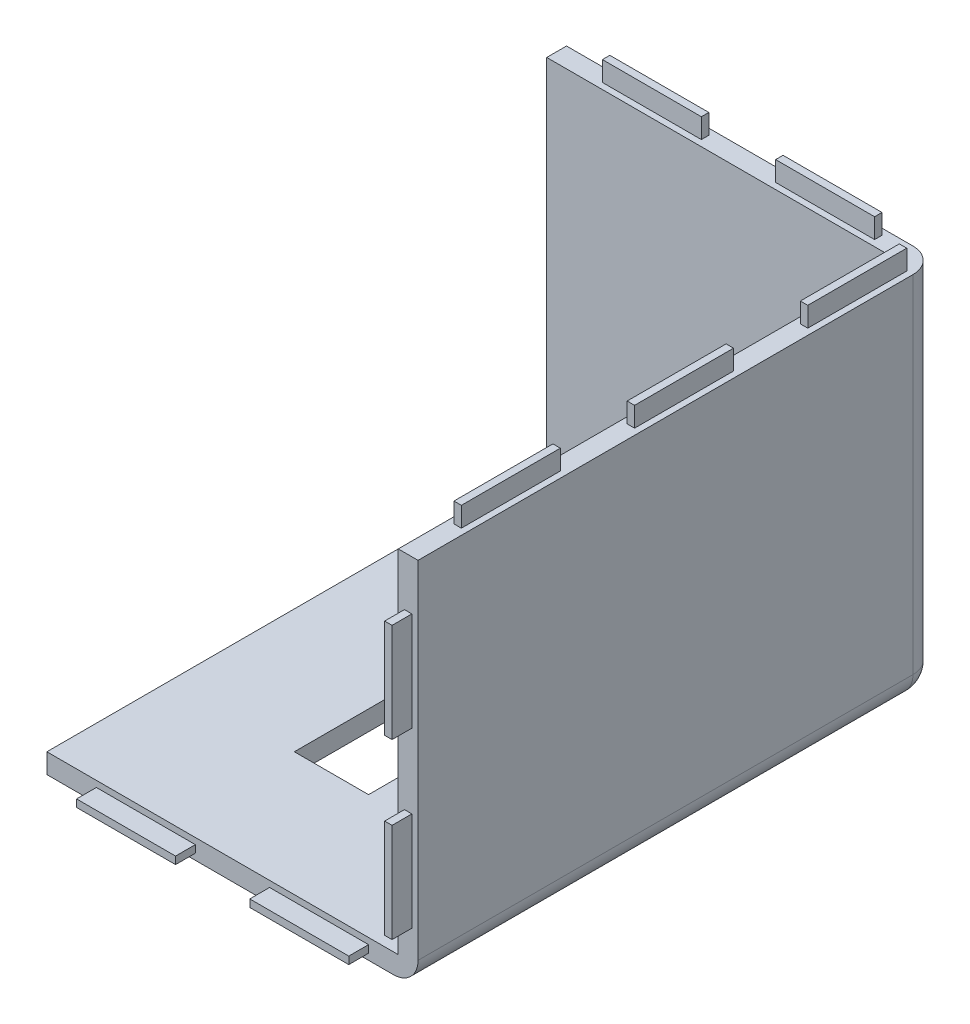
ISO-10303-21;
HEADER;
FILE_DESCRIPTION(('STEP AP214'),'2;1');
FILE_NAME('part.step','',(''),(''),'','','');
FILE_SCHEMA(('AUTOMOTIVE_DESIGN { 1 0 10303 214 1 1 1 1 }'));
ENDSEC;
DATA;
#1=APPLICATION_CONTEXT('core data for automotive mechanical design processes');
#2=APPLICATION_PROTOCOL_DEFINITION('international standard','automotive_design',2000,#1);
#3=PRODUCT_CONTEXT('',#1,'mechanical');
#4=PRODUCT('Part','Part','',(#3));
#5=PRODUCT_RELATED_PRODUCT_CATEGORY('part','',(#4));
#6=PRODUCT_DEFINITION_FORMATION('','',#4);
#7=PRODUCT_DEFINITION_CONTEXT('part definition',#1,'design');
#8=PRODUCT_DEFINITION('design','',#6,#7);
#9=PRODUCT_DEFINITION_SHAPE('','',#8);
#10=(LENGTH_UNIT() NAMED_UNIT(*) SI_UNIT(.MILLI.,.METRE.));
#11=(NAMED_UNIT(*) PLANE_ANGLE_UNIT() SI_UNIT($,.RADIAN.));
#12=(NAMED_UNIT(*) SI_UNIT($,.STERADIAN.) SOLID_ANGLE_UNIT());
#13=UNCERTAINTY_MEASURE_WITH_UNIT(LENGTH_MEASURE(1.E-05),#10,'distance_accuracy_value','');
#14=(GEOMETRIC_REPRESENTATION_CONTEXT(3) GLOBAL_UNCERTAINTY_ASSIGNED_CONTEXT((#13)) GLOBAL_UNIT_ASSIGNED_CONTEXT((#10,
#11,#12)) REPRESENTATION_CONTEXT('',''));
#15=CARTESIAN_POINT('',(0.,0.,0.));
#16=DIRECTION('',(0.,0.,1.));
#17=DIRECTION('',(1.,0.,0.));
#18=AXIS2_PLACEMENT_3D('',#15,#16,#17);
#19=CARTESIAN_POINT('',(0.,150.,0.));
#20=DIRECTION('',(0.,0.,-1.));
#21=DIRECTION('',(-1.,0.,0.));
#22=AXIS2_PLACEMENT_3D('',#19,#20,#21);
#23=PLANE('',#22);
#24=DIRECTION('',(0.,-1.,0.));
#25=VECTOR('',#24,1.);
#26=CARTESIAN_POINT('',(20.,5.5,0.));
#27=LINE('',#26,#25);
#28=CARTESIAN_POINT('',(20.,5.5,0.));
#29=VERTEX_POINT('',#28);
#30=CARTESIAN_POINT('',(20.,2.5,0.));
#31=VERTEX_POINT('',#30);
#32=EDGE_CURVE('E614',#29,#31,#27,.T.);
#33=ORIENTED_EDGE('',*,*,#32,.F.);
#34=DIRECTION('',(-1.,0.,0.));
#35=VECTOR('',#34,1.);
#36=CARTESIAN_POINT('',(20.,5.5,0.));
#37=LINE('',#36,#35);
#38=CARTESIAN_POINT('',(60.,5.50000000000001,0.));
#39=VERTEX_POINT('',#38);
#40=EDGE_CURVE('E601',#39,#29,#37,.T.);
#41=ORIENTED_EDGE('',*,*,#40,.F.);
#42=DIRECTION('',(0.,1.,0.));
#43=VECTOR('',#42,1.);
#44=CARTESIAN_POINT('',(60.,5.5,0.));
#45=LINE('',#44,#43);
#46=CARTESIAN_POINT('',(60.,2.5,0.));
#47=VERTEX_POINT('',#46);
#48=EDGE_CURVE('E605',#47,#39,#45,.T.);
#49=ORIENTED_EDGE('',*,*,#48,.F.);
#50=DIRECTION('',(1.,0.,0.));
#51=VECTOR('',#50,1.);
#52=CARTESIAN_POINT('',(20.,2.5,0.));
#53=LINE('',#52,#51);
#54=EDGE_CURVE('E610',#31,#47,#53,.T.);
#55=ORIENTED_EDGE('',*,*,#54,.F.);
#56=EDGE_LOOP('',(#33,#41,#49,#55));
#57=FACE_BOUND('',#56,.T.);
#58=DIRECTION('',(0.,-1.,0.));
#59=VECTOR('',#58,1.);
#60=CARTESIAN_POINT('',(144.5,130.,0.));
#61=LINE('',#60,#59);
#62=CARTESIAN_POINT('',(144.5,130.,0.));
#63=VERTEX_POINT('',#62);
#64=CARTESIAN_POINT('',(144.5,90.,0.));
#65=VERTEX_POINT('',#64);
#66=EDGE_CURVE('E663',#63,#65,#61,.T.);
#67=ORIENTED_EDGE('',*,*,#66,.F.);
#68=DIRECTION('',(-1.,0.,0.));
#69=VECTOR('',#68,1.);
#70=CARTESIAN_POINT('',(144.5,130.,0.));
#71=LINE('',#70,#69);
#72=CARTESIAN_POINT('',(147.5,130.,0.));
#73=VERTEX_POINT('',#72);
#74=EDGE_CURVE('E680',#73,#63,#71,.T.);
#75=ORIENTED_EDGE('',*,*,#74,.F.);
#76=DIRECTION('',(0.,1.,0.));
#77=VECTOR('',#76,1.);
#78=CARTESIAN_POINT('',(147.5,130.,0.));
#79=LINE('',#78,#77);
#80=CARTESIAN_POINT('',(147.5,90.,0.));
#81=VERTEX_POINT('',#80);
#82=EDGE_CURVE('E697',#81,#73,#79,.T.);
#83=ORIENTED_EDGE('',*,*,#82,.F.);
#84=DIRECTION('',(1.,0.,0.));
#85=VECTOR('',#84,1.);
#86=CARTESIAN_POINT('',(144.5,90.,0.));
#87=LINE('',#86,#85);
#88=EDGE_CURVE('E693',#65,#81,#87,.T.);
#89=ORIENTED_EDGE('',*,*,#88,.F.);
#90=EDGE_LOOP('',(#67,#75,#83,#89));
#91=FACE_BOUND('',#90,.T.);
#92=DIRECTION('',(1.,0.,0.));
#93=VECTOR('',#92,1.);
#94=CARTESIAN_POINT('',(0.,0.,0.));
#95=LINE('',#94,#93);
#96=CARTESIAN_POINT('',(0.,0.,0.));
#97=VERTEX_POINT('',#96);
#98=CARTESIAN_POINT('',(140.,0.,0.));
#99=VERTEX_POINT('',#98);
#100=EDGE_CURVE('E1202',#97,#99,#95,.T.);
#101=ORIENTED_EDGE('',*,*,#100,.T.);
#102=CARTESIAN_POINT('',(140.,10.,0.));
#103=DIRECTION('',(0.,0.,-1.));
#104=DIRECTION('',(-1.,0.,0.));
#105=AXIS2_PLACEMENT_3D('',#102,#103,#104);
#106=CIRCLE('',#105,10.);
#107=CARTESIAN_POINT('',(150.,10.,0.));
#108=VERTEX_POINT('',#107);
#109=EDGE_CURVE('E57',#99,#108,#106,.F.);
#110=ORIENTED_EDGE('',*,*,#109,.T.);
#111=DIRECTION('',(0.,-1.,0.));
#112=VECTOR('',#111,1.);
#113=CARTESIAN_POINT('',(150.,150.,0.));
#114=LINE('',#113,#112);
#115=CARTESIAN_POINT('',(150.,150.,0.));
#116=VERTEX_POINT('',#115);
#117=EDGE_CURVE('E1220',#116,#108,#114,.T.);
#118=ORIENTED_EDGE('',*,*,#117,.F.);
#119=DIRECTION('',(1.,0.,0.));
#120=VECTOR('',#119,1.);
#121=CARTESIAN_POINT('',(0.,150.,0.));
#122=LINE('',#121,#120);
#123=CARTESIAN_POINT('',(142.,150.,0.));
#124=VERTEX_POINT('',#123);
#125=EDGE_CURVE('E1201',#124,#116,#122,.T.);
#126=ORIENTED_EDGE('',*,*,#125,.F.);
#127=DIRECTION('',(0.,1.,0.));
#128=VECTOR('',#127,1.);
#129=CARTESIAN_POINT('',(142.,8.00000000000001,0.));
#130=LINE('',#129,#128);
#131=CARTESIAN_POINT('',(142.,8.00000000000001,0.));
#132=VERTEX_POINT('',#131);
#133=EDGE_CURVE('E1181',#132,#124,#130,.T.);
#134=ORIENTED_EDGE('',*,*,#133,.F.);
#135=DIRECTION('',(1.,0.,0.));
#136=VECTOR('',#135,1.);
#137=CARTESIAN_POINT('',(0.,8.00000000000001,0.));
#138=LINE('',#137,#136);
#139=CARTESIAN_POINT('',(0.,8.00000000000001,0.));
#140=VERTEX_POINT('',#139);
#141=EDGE_CURVE('E1168',#140,#132,#138,.T.);
#142=ORIENTED_EDGE('',*,*,#141,.F.);
#143=DIRECTION('',(0.,-1.,0.));
#144=VECTOR('',#143,1.);
#145=CARTESIAN_POINT('',(0.,150.,0.));
#146=LINE('',#145,#144);
#147=EDGE_CURVE('E1223',#140,#97,#146,.T.);
#148=ORIENTED_EDGE('',*,*,#147,.T.);
#149=EDGE_LOOP('',(#101,#110,#118,#126,#134,#142,#148));
#150=FACE_BOUND('',#149,.T.);
#151=DIRECTION('',(0.,-1.,0.));
#152=VECTOR('',#151,1.);
#153=CARTESIAN_POINT('',(144.5,60.,0.));
#154=LINE('',#153,#152);
#155=CARTESIAN_POINT('',(144.5,60.,0.));
#156=VERTEX_POINT('',#155);
#157=CARTESIAN_POINT('',(144.5,20.,0.));
#158=VERTEX_POINT('',#157);
#159=EDGE_CURVE('E659',#156,#158,#154,.T.);
#160=ORIENTED_EDGE('',*,*,#159,.F.);
#161=DIRECTION('',(-1.,0.,0.));
#162=VECTOR('',#161,1.);
#163=CARTESIAN_POINT('',(144.5,60.,0.));
#164=LINE('',#163,#162);
#165=CARTESIAN_POINT('',(147.5,60.,0.));
#166=VERTEX_POINT('',#165);
#167=EDGE_CURVE('E646',#166,#156,#164,.T.);
#168=ORIENTED_EDGE('',*,*,#167,.F.);
#169=DIRECTION('',(0.,1.,0.));
#170=VECTOR('',#169,1.);
#171=CARTESIAN_POINT('',(147.5,60.,0.));
#172=LINE('',#171,#170);
#173=CARTESIAN_POINT('',(147.5,20.,0.));
#174=VERTEX_POINT('',#173);
#175=EDGE_CURVE('E650',#174,#166,#172,.T.);
#176=ORIENTED_EDGE('',*,*,#175,.F.);
#177=DIRECTION('',(1.,0.,0.));
#178=VECTOR('',#177,1.);
#179=CARTESIAN_POINT('',(144.5,20.,0.));
#180=LINE('',#179,#178);
#181=EDGE_CURVE('E655',#158,#174,#180,.T.);
#182=ORIENTED_EDGE('',*,*,#181,.F.);
#183=EDGE_LOOP('',(#160,#168,#176,#182));
#184=FACE_BOUND('',#183,.T.);
#185=DIRECTION('',(0.,-1.,0.));
#186=VECTOR('',#185,1.);
#187=CARTESIAN_POINT('',(90.,5.50000000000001,0.));
#188=LINE('',#187,#186);
#189=CARTESIAN_POINT('',(90.,5.50000000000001,0.));
#190=VERTEX_POINT('',#189);
#191=CARTESIAN_POINT('',(90.,2.5,0.));
#192=VERTEX_POINT('',#191);
#193=EDGE_CURVE('E569',#190,#192,#188,.T.);
#194=ORIENTED_EDGE('',*,*,#193,.F.);
#195=DIRECTION('',(-1.,0.,0.));
#196=VECTOR('',#195,1.);
#197=CARTESIAN_POINT('',(90.,5.50000000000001,0.));
#198=LINE('',#197,#196);
#199=CARTESIAN_POINT('',(130.,5.50000000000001,0.));
#200=VERTEX_POINT('',#199);
#201=EDGE_CURVE('E556',#200,#190,#198,.T.);
#202=ORIENTED_EDGE('',*,*,#201,.F.);
#203=DIRECTION('',(0.,1.,0.));
#204=VECTOR('',#203,1.);
#205=CARTESIAN_POINT('',(130.,5.50000000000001,0.));
#206=LINE('',#205,#204);
#207=CARTESIAN_POINT('',(130.,2.5,0.));
#208=VERTEX_POINT('',#207);
#209=EDGE_CURVE('E560',#208,#200,#206,.T.);
#210=ORIENTED_EDGE('',*,*,#209,.F.);
#211=DIRECTION('',(1.,0.,0.));
#212=VECTOR('',#211,1.);
#213=CARTESIAN_POINT('',(90.,2.50000000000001,0.));
#214=LINE('',#213,#212);
#215=EDGE_CURVE('E565',#192,#208,#214,.T.);
#216=ORIENTED_EDGE('',*,*,#215,.F.);
#217=EDGE_LOOP('',(#194,#202,#210,#216));
#218=FACE_BOUND('',#217,.T.);
#219=ADVANCED_FACE('F47',(#57,#91,#150,#184,#218),#23,.F.);
#220=CARTESIAN_POINT('',(0.,150.,0.));
#221=DIRECTION('',(0.,-1.,0.));
#222=DIRECTION('',(0.,0.,-1.));
#223=AXIS2_PLACEMENT_3D('',#220,#221,#222);
#224=PLANE('',#223);
#225=DIRECTION('',(0.,0.,1.));
#226=VECTOR('',#225,1.);
#227=CARTESIAN_POINT('',(144.5,150.,-90.));
#228=LINE('',#227,#226);
#229=CARTESIAN_POINT('',(144.5,150.,-130.));
#230=VERTEX_POINT('',#229);
#231=CARTESIAN_POINT('',(144.5,150.,-90.));
#232=VERTEX_POINT('',#231);
#233=EDGE_CURVE('E1014',#230,#232,#228,.T.);
#234=ORIENTED_EDGE('',*,*,#233,.F.);
#235=DIRECTION('',(-1.,0.,0.));
#236=VECTOR('',#235,1.);
#237=CARTESIAN_POINT('',(144.5,150.,-130.));
#238=LINE('',#237,#236);
#239=CARTESIAN_POINT('',(147.5,150.,-130.));
#240=VERTEX_POINT('',#239);
#241=EDGE_CURVE('E1001',#240,#230,#238,.T.);
#242=ORIENTED_EDGE('',*,*,#241,.F.);
#243=DIRECTION('',(0.,0.,-1.));
#244=VECTOR('',#243,1.);
#245=CARTESIAN_POINT('',(147.5,150.,-90.));
#246=LINE('',#245,#244);
#247=CARTESIAN_POINT('',(147.5,150.,-90.));
#248=VERTEX_POINT('',#247);
#249=EDGE_CURVE('E1005',#248,#240,#246,.T.);
#250=ORIENTED_EDGE('',*,*,#249,.F.);
#251=DIRECTION('',(1.,0.,0.));
#252=VECTOR('',#251,1.);
#253=CARTESIAN_POINT('',(144.5,150.,-90.));
#254=LINE('',#253,#252);
#255=EDGE_CURVE('E1010',#232,#248,#254,.T.);
#256=ORIENTED_EDGE('',*,*,#255,.F.);
#257=EDGE_LOOP('',(#234,#242,#250,#256));
#258=FACE_BOUND('',#257,.T.);
#259=DIRECTION('',(0.,0.,1.));
#260=VECTOR('',#259,1.);
#261=CARTESIAN_POINT('',(90.,150.,-207.5));
#262=LINE('',#261,#260);
#263=CARTESIAN_POINT('',(90.,150.,-207.5));
#264=VERTEX_POINT('',#263);
#265=CARTESIAN_POINT('',(90.,150.,-204.5));
#266=VERTEX_POINT('',#265);
#267=EDGE_CURVE('E1104',#264,#266,#262,.T.);
#268=ORIENTED_EDGE('',*,*,#267,.F.);
#269=DIRECTION('',(-1.,0.,0.));
#270=VECTOR('',#269,1.);
#271=CARTESIAN_POINT('',(90.,150.,-207.5));
#272=LINE('',#271,#270);
#273=CARTESIAN_POINT('',(130.,150.,-207.5));
#274=VERTEX_POINT('',#273);
#275=EDGE_CURVE('E1091',#274,#264,#272,.T.);
#276=ORIENTED_EDGE('',*,*,#275,.F.);
#277=DIRECTION('',(0.,0.,-1.));
#278=VECTOR('',#277,1.);
#279=CARTESIAN_POINT('',(130.,150.,-207.5));
#280=LINE('',#279,#278);
#281=CARTESIAN_POINT('',(130.,150.,-204.5));
#282=VERTEX_POINT('',#281);
#283=EDGE_CURVE('E1095',#282,#274,#280,.T.);
#284=ORIENTED_EDGE('',*,*,#283,.F.);
#285=DIRECTION('',(1.,0.,0.));
#286=VECTOR('',#285,1.);
#287=CARTESIAN_POINT('',(90.,150.,-204.5));
#288=LINE('',#287,#286);
#289=EDGE_CURVE('E1100',#266,#282,#288,.T.);
#290=ORIENTED_EDGE('',*,*,#289,.F.);
#291=EDGE_LOOP('',(#268,#276,#284,#290));
#292=FACE_BOUND('',#291,.T.);
#293=DIRECTION('',(0.,0.,-1.));
#294=VECTOR('',#293,1.);
#295=CARTESIAN_POINT('',(150.,150.,0.));
#296=LINE('',#295,#294);
#297=CARTESIAN_POINT('',(150.,150.,-200.));
#298=VERTEX_POINT('',#297);
#299=EDGE_CURVE('E1205',#116,#298,#296,.T.);
#300=ORIENTED_EDGE('',*,*,#299,.T.);
#301=CARTESIAN_POINT('',(140.,150.,-200.));
#302=DIRECTION('',(0.,-1.,0.));
#303=DIRECTION('',(0.,0.,-1.));
#304=AXIS2_PLACEMENT_3D('',#301,#302,#303);
#305=CIRCLE('',#304,10.);
#306=CARTESIAN_POINT('',(140.,150.,-210.));
#307=VERTEX_POINT('',#306);
#308=EDGE_CURVE('E11',#298,#307,#305,.F.);
#309=ORIENTED_EDGE('',*,*,#308,.T.);
#310=DIRECTION('',(-1.,0.,0.));
#311=VECTOR('',#310,1.);
#312=CARTESIAN_POINT('',(0.,150.,-210.));
#313=LINE('',#312,#311);
#314=CARTESIAN_POINT('',(0.,150.,-210.));
#315=VERTEX_POINT('',#314);
#316=EDGE_CURVE('E1209',#307,#315,#313,.T.);
#317=ORIENTED_EDGE('',*,*,#316,.T.);
#318=DIRECTION('',(0.,0.,1.));
#319=VECTOR('',#318,1.);
#320=CARTESIAN_POINT('',(0.,150.,0.));
#321=LINE('',#320,#319);
#322=CARTESIAN_POINT('',(0.,150.,-202.));
#323=VERTEX_POINT('',#322);
#324=EDGE_CURVE('E1197',#315,#323,#321,.T.);
#325=ORIENTED_EDGE('',*,*,#324,.T.);
#326=DIRECTION('',(-1.,0.,0.));
#327=VECTOR('',#326,1.);
#328=CARTESIAN_POINT('',(0.,150.,-202.));
#329=LINE('',#328,#327);
#330=CARTESIAN_POINT('',(142.,150.,-202.));
#331=VERTEX_POINT('',#330);
#332=EDGE_CURVE('E1169',#331,#323,#329,.T.);
#333=ORIENTED_EDGE('',*,*,#332,.F.);
#334=DIRECTION('',(0.,0.,-1.));
#335=VECTOR('',#334,1.);
#336=CARTESIAN_POINT('',(142.,150.,-202.));
#337=LINE('',#336,#335);
#338=EDGE_CURVE('E1164',#124,#331,#337,.T.);
#339=ORIENTED_EDGE('',*,*,#338,.F.);
#340=ORIENTED_EDGE('',*,*,#125,.T.);
#341=EDGE_LOOP('',(#300,#309,#317,#325,#333,#339,#340));
#342=FACE_BOUND('',#341,.T.);
#343=DIRECTION('',(0.,0.,1.));
#344=VECTOR('',#343,1.);
#345=CARTESIAN_POINT('',(20.,150.,-207.5));
#346=LINE('',#345,#344);
#347=CARTESIAN_POINT('',(20.,150.,-207.5));
#348=VERTEX_POINT('',#347);
#349=CARTESIAN_POINT('',(20.,150.,-204.5));
#350=VERTEX_POINT('',#349);
#351=EDGE_CURVE('E1108',#348,#350,#346,.T.);
#352=ORIENTED_EDGE('',*,*,#351,.F.);
#353=DIRECTION('',(-1.,0.,0.));
#354=VECTOR('',#353,1.);
#355=CARTESIAN_POINT('',(20.,150.,-207.5));
#356=LINE('',#355,#354);
#357=CARTESIAN_POINT('',(60.,150.,-207.5));
#358=VERTEX_POINT('',#357);
#359=EDGE_CURVE('E1125',#358,#348,#356,.T.);
#360=ORIENTED_EDGE('',*,*,#359,.F.);
#361=DIRECTION('',(0.,0.,-1.));
#362=VECTOR('',#361,1.);
#363=CARTESIAN_POINT('',(60.,150.,-207.5));
#364=LINE('',#363,#362);
#365=CARTESIAN_POINT('',(60.,150.,-204.5));
#366=VERTEX_POINT('',#365);
#367=EDGE_CURVE('E1142',#366,#358,#364,.T.);
#368=ORIENTED_EDGE('',*,*,#367,.F.);
#369=DIRECTION('',(1.,0.,0.));
#370=VECTOR('',#369,1.);
#371=CARTESIAN_POINT('',(20.,150.,-204.5));
#372=LINE('',#371,#370);
#373=EDGE_CURVE('E1138',#350,#366,#372,.T.);
#374=ORIENTED_EDGE('',*,*,#373,.F.);
#375=EDGE_LOOP('',(#352,#360,#368,#374));
#376=FACE_BOUND('',#375,.T.);
#377=DIRECTION('',(0.,0.,1.));
#378=VECTOR('',#377,1.);
#379=CARTESIAN_POINT('',(144.5,150.,-20.));
#380=LINE('',#379,#378);
#381=CARTESIAN_POINT('',(144.5,150.,-60.));
#382=VERTEX_POINT('',#381);
#383=CARTESIAN_POINT('',(144.5,150.,-20.));
#384=VERTEX_POINT('',#383);
#385=EDGE_CURVE('E1059',#382,#384,#380,.T.);
#386=ORIENTED_EDGE('',*,*,#385,.F.);
#387=DIRECTION('',(-1.,0.,0.));
#388=VECTOR('',#387,1.);
#389=CARTESIAN_POINT('',(144.5,150.,-60.));
#390=LINE('',#389,#388);
#391=CARTESIAN_POINT('',(147.5,150.,-60.));
#392=VERTEX_POINT('',#391);
#393=EDGE_CURVE('E1046',#392,#382,#390,.T.);
#394=ORIENTED_EDGE('',*,*,#393,.F.);
#395=DIRECTION('',(0.,0.,-1.));
#396=VECTOR('',#395,1.);
#397=CARTESIAN_POINT('',(147.5,150.,-20.));
#398=LINE('',#397,#396);
#399=CARTESIAN_POINT('',(147.5,150.,-20.));
#400=VERTEX_POINT('',#399);
#401=EDGE_CURVE('E1050',#400,#392,#398,.T.);
#402=ORIENTED_EDGE('',*,*,#401,.F.);
#403=DIRECTION('',(1.,0.,0.));
#404=VECTOR('',#403,1.);
#405=CARTESIAN_POINT('',(144.5,150.,-20.));
#406=LINE('',#405,#404);
#407=EDGE_CURVE('E1055',#384,#400,#406,.T.);
#408=ORIENTED_EDGE('',*,*,#407,.F.);
#409=EDGE_LOOP('',(#386,#394,#402,#408));
#410=FACE_BOUND('',#409,.T.);
#411=DIRECTION('',(0.,0.,1.));
#412=VECTOR('',#411,1.);
#413=CARTESIAN_POINT('',(144.5,150.,-160.));
#414=LINE('',#413,#412);
#415=CARTESIAN_POINT('',(144.5,150.,-200.));
#416=VERTEX_POINT('',#415);
#417=CARTESIAN_POINT('',(144.5,150.,-160.));
#418=VERTEX_POINT('',#417);
#419=EDGE_CURVE('E969',#416,#418,#414,.T.);
#420=ORIENTED_EDGE('',*,*,#419,.F.);
#421=DIRECTION('',(-1.,0.,0.));
#422=VECTOR('',#421,1.);
#423=CARTESIAN_POINT('',(144.5,150.,-200.));
#424=LINE('',#423,#422);
#425=CARTESIAN_POINT('',(147.5,150.,-200.));
#426=VERTEX_POINT('',#425);
#427=EDGE_CURVE('E956',#426,#416,#424,.T.);
#428=ORIENTED_EDGE('',*,*,#427,.F.);
#429=DIRECTION('',(0.,0.,-1.));
#430=VECTOR('',#429,1.);
#431=CARTESIAN_POINT('',(147.5,150.,-160.));
#432=LINE('',#431,#430);
#433=CARTESIAN_POINT('',(147.5,150.,-160.));
#434=VERTEX_POINT('',#433);
#435=EDGE_CURVE('E960',#434,#426,#432,.T.);
#436=ORIENTED_EDGE('',*,*,#435,.F.);
#437=DIRECTION('',(1.,0.,0.));
#438=VECTOR('',#437,1.);
#439=CARTESIAN_POINT('',(144.5,150.,-160.));
#440=LINE('',#439,#438);
#441=EDGE_CURVE('E965',#418,#434,#440,.T.);
#442=ORIENTED_EDGE('',*,*,#441,.F.);
#443=EDGE_LOOP('',(#420,#428,#436,#442));
#444=FACE_BOUND('',#443,.T.);
#445=ADVANCED_FACE('F1281',(#258,#292,#342,#376,#410,#444),#224,.F.);
#446=CARTESIAN_POINT('',(0.,150.,0.));
#447=DIRECTION('',(1.,0.,0.));
#448=DIRECTION('',(0.,0.,-1.));
#449=AXIS2_PLACEMENT_3D('',#446,#447,#448);
#450=PLANE('',#449);
#451=DIRECTION('',(0.,0.,1.));
#452=VECTOR('',#451,1.);
#453=CARTESIAN_POINT('',(0.,90.,-207.5));
#454=LINE('',#453,#452);
#455=CARTESIAN_POINT('',(0.,90.,-207.5));
#456=VERTEX_POINT('',#455);
#457=CARTESIAN_POINT('',(0.,90.,-204.5));
#458=VERTEX_POINT('',#457);
#459=EDGE_CURVE('E741',#456,#458,#454,.T.);
#460=ORIENTED_EDGE('',*,*,#459,.F.);
#461=DIRECTION('',(0.,-1.,0.));
#462=VECTOR('',#461,1.);
#463=CARTESIAN_POINT('',(0.,130.,-207.5));
#464=LINE('',#463,#462);
#465=CARTESIAN_POINT('',(0.,130.,-207.5));
#466=VERTEX_POINT('',#465);
#467=EDGE_CURVE('E738',#466,#456,#464,.T.);
#468=ORIENTED_EDGE('',*,*,#467,.F.);
#469=DIRECTION('',(0.,0.,-1.));
#470=VECTOR('',#469,1.);
#471=CARTESIAN_POINT('',(0.,130.,-207.5));
#472=LINE('',#471,#470);
#473=CARTESIAN_POINT('',(0.,130.,-204.5));
#474=VERTEX_POINT('',#473);
#475=EDGE_CURVE('E725',#474,#466,#472,.T.);
#476=ORIENTED_EDGE('',*,*,#475,.F.);
#477=DIRECTION('',(0.,1.,0.));
#478=VECTOR('',#477,1.);
#479=CARTESIAN_POINT('',(0.,130.,-204.5));
#480=LINE('',#479,#478);
#481=EDGE_CURVE('E746',#458,#474,#480,.T.);
#482=ORIENTED_EDGE('',*,*,#481,.F.);
#483=EDGE_LOOP('',(#460,#468,#476,#482));
#484=FACE_BOUND('',#483,.T.);
#485=DIRECTION('',(0.,0.,-1.));
#486=VECTOR('',#485,1.);
#487=CARTESIAN_POINT('',(0.,5.5,-160.));
#488=LINE('',#487,#486);
#489=CARTESIAN_POINT('',(0.,5.50000000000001,-160.));
#490=VERTEX_POINT('',#489);
#491=CARTESIAN_POINT('',(0.,5.49999999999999,-200.));
#492=VERTEX_POINT('',#491);
#493=EDGE_CURVE('E834',#490,#492,#488,.T.);
#494=ORIENTED_EDGE('',*,*,#493,.F.);
#495=DIRECTION('',(0.,1.,0.));
#496=VECTOR('',#495,1.);
#497=CARTESIAN_POINT('',(0.,5.5,-160.));
#498=LINE('',#497,#496);
#499=CARTESIAN_POINT('',(0.,2.5,-160.));
#500=VERTEX_POINT('',#499);
#501=EDGE_CURVE('E780',#500,#490,#498,.T.);
#502=ORIENTED_EDGE('',*,*,#501,.F.);
#503=DIRECTION('',(0.,0.,1.));
#504=VECTOR('',#503,1.);
#505=CARTESIAN_POINT('',(0.,2.5,-160.));
#506=LINE('',#505,#504);
#507=CARTESIAN_POINT('',(0.,2.49999999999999,-200.));
#508=VERTEX_POINT('',#507);
#509=EDGE_CURVE('E825',#508,#500,#506,.T.);
#510=ORIENTED_EDGE('',*,*,#509,.F.);
#511=DIRECTION('',(0.,-1.,0.));
#512=VECTOR('',#511,1.);
#513=CARTESIAN_POINT('',(0.,5.49999999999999,-200.));
#514=LINE('',#513,#512);
#515=EDGE_CURVE('E829',#492,#508,#514,.T.);
#516=ORIENTED_EDGE('',*,*,#515,.F.);
#517=EDGE_LOOP('',(#494,#502,#510,#516));
#518=FACE_BOUND('',#517,.T.);
#519=DIRECTION('',(0.,0.,-1.));
#520=VECTOR('',#519,1.);
#521=CARTESIAN_POINT('',(0.,5.5,-90.));
#522=LINE('',#521,#520);
#523=CARTESIAN_POINT('',(0.,5.49999999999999,-90.));
#524=VERTEX_POINT('',#523);
#525=CARTESIAN_POINT('',(0.,5.5,-130.));
#526=VERTEX_POINT('',#525);
#527=EDGE_CURVE('E790',#524,#526,#522,.T.);
#528=ORIENTED_EDGE('',*,*,#527,.F.);
#529=DIRECTION('',(0.,1.,0.));
#530=VECTOR('',#529,1.);
#531=CARTESIAN_POINT('',(0.,5.5,-90.));
#532=LINE('',#531,#530);
#533=CARTESIAN_POINT('',(0.,2.5,-90.));
#534=VERTEX_POINT('',#533);
#535=EDGE_CURVE('E794',#534,#524,#532,.T.);
#536=ORIENTED_EDGE('',*,*,#535,.F.);
#537=DIRECTION('',(0.,0.,1.));
#538=VECTOR('',#537,1.);
#539=CARTESIAN_POINT('',(0.,2.5,-90.));
#540=LINE('',#539,#538);
#541=CARTESIAN_POINT('',(0.,2.5,-130.));
#542=VERTEX_POINT('',#541);
#543=EDGE_CURVE('E781',#542,#534,#540,.T.);
#544=ORIENTED_EDGE('',*,*,#543,.F.);
#545=DIRECTION('',(0.,-1.,0.));
#546=VECTOR('',#545,1.);
#547=CARTESIAN_POINT('',(0.,5.5,-130.));
#548=LINE('',#547,#546);
#549=EDGE_CURVE('E785',#526,#542,#548,.T.);
#550=ORIENTED_EDGE('',*,*,#549,.F.);
#551=EDGE_LOOP('',(#528,#536,#544,#550));
#552=FACE_BOUND('',#551,.T.);
#553=DIRECTION('',(0.,0.,-1.));
#554=VECTOR('',#553,1.);
#555=CARTESIAN_POINT('',(0.,5.5,-20.));
#556=LINE('',#555,#554);
#557=CARTESIAN_POINT('',(0.,5.5,-20.));
#558=VERTEX_POINT('',#557);
#559=CARTESIAN_POINT('',(0.,5.49999999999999,-60.));
#560=VERTEX_POINT('',#559);
#561=EDGE_CURVE('E920',#558,#560,#556,.T.);
#562=ORIENTED_EDGE('',*,*,#561,.F.);
#563=DIRECTION('',(0.,1.,0.));
#564=VECTOR('',#563,1.);
#565=CARTESIAN_POINT('',(0.,5.5,-20.));
#566=LINE('',#565,#564);
#567=CARTESIAN_POINT('',(0.,2.5,-20.));
#568=VERTEX_POINT('',#567);
#569=EDGE_CURVE('E868',#568,#558,#566,.T.);
#570=ORIENTED_EDGE('',*,*,#569,.F.);
#571=DIRECTION('',(0.,0.,1.));
#572=VECTOR('',#571,1.);
#573=CARTESIAN_POINT('',(0.,2.5,-20.));
#574=LINE('',#573,#572);
#575=CARTESIAN_POINT('',(0.,2.49999999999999,-60.));
#576=VERTEX_POINT('',#575);
#577=EDGE_CURVE('E911',#576,#568,#574,.T.);
#578=ORIENTED_EDGE('',*,*,#577,.F.);
#579=DIRECTION('',(0.,-1.,0.));
#580=VECTOR('',#579,1.);
#581=CARTESIAN_POINT('',(0.,5.49999999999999,-60.));
#582=LINE('',#581,#580);
#583=EDGE_CURVE('E915',#560,#576,#582,.T.);
#584=ORIENTED_EDGE('',*,*,#583,.F.);
#585=EDGE_LOOP('',(#562,#570,#578,#584));
#586=FACE_BOUND('',#585,.T.);
#587=DIRECTION('',(0.,0.,1.));
#588=VECTOR('',#587,1.);
#589=CARTESIAN_POINT('',(0.,20.,-207.5));
#590=LINE('',#589,#588);
#591=CARTESIAN_POINT('',(0.,20.,-207.5));
#592=VERTEX_POINT('',#591);
#593=CARTESIAN_POINT('',(0.,20.,-204.5));
#594=VERTEX_POINT('',#593);
#595=EDGE_CURVE('E878',#592,#594,#590,.T.);
#596=ORIENTED_EDGE('',*,*,#595,.F.);
#597=DIRECTION('',(0.,-1.,0.));
#598=VECTOR('',#597,1.);
#599=CARTESIAN_POINT('',(0.,60.,-207.5));
#600=LINE('',#599,#598);
#601=CARTESIAN_POINT('',(0.,60.,-207.5));
#602=VERTEX_POINT('',#601);
#603=EDGE_CURVE('E742',#602,#592,#600,.T.);
#604=ORIENTED_EDGE('',*,*,#603,.F.);
#605=DIRECTION('',(0.,0.,-1.));
#606=VECTOR('',#605,1.);
#607=CARTESIAN_POINT('',(0.,60.,-207.5));
#608=LINE('',#607,#606);
#609=CARTESIAN_POINT('',(0.,60.,-204.5));
#610=VERTEX_POINT('',#609);
#611=EDGE_CURVE('E869',#610,#602,#608,.T.);
#612=ORIENTED_EDGE('',*,*,#611,.F.);
#613=DIRECTION('',(0.,1.,0.));
#614=VECTOR('',#613,1.);
#615=CARTESIAN_POINT('',(0.,60.,-204.5));
#616=LINE('',#615,#614);
#617=EDGE_CURVE('E873',#594,#610,#616,.T.);
#618=ORIENTED_EDGE('',*,*,#617,.F.);
#619=EDGE_LOOP('',(#596,#604,#612,#618));
#620=FACE_BOUND('',#619,.T.);
#621=DIRECTION('',(0.,-1.,0.));
#622=VECTOR('',#621,1.);
#623=CARTESIAN_POINT('',(0.,150.,-210.));
#624=LINE('',#623,#622);
#625=CARTESIAN_POINT('',(0.,10.,-210.));
#626=VERTEX_POINT('',#625);
#627=EDGE_CURVE('E1212',#315,#626,#624,.T.);
#628=ORIENTED_EDGE('',*,*,#627,.T.);
#629=CARTESIAN_POINT('',(0.,10.,-200.));
#630=DIRECTION('',(1.,0.,0.));
#631=DIRECTION('',(0.,0.,-1.));
#632=AXIS2_PLACEMENT_3D('',#629,#630,#631);
#633=CIRCLE('',#632,10.);
#634=CARTESIAN_POINT('',(0.,0.,-200.));
#635=VERTEX_POINT('',#634);
#636=EDGE_CURVE('E1234',#626,#635,#633,.F.);
#637=ORIENTED_EDGE('',*,*,#636,.T.);
#638=DIRECTION('',(0.,0.,1.));
#639=VECTOR('',#638,1.);
#640=CARTESIAN_POINT('',(0.,0.,0.));
#641=LINE('',#640,#639);
#642=EDGE_CURVE('E1191',#635,#97,#641,.T.);
#643=ORIENTED_EDGE('',*,*,#642,.T.);
#644=ORIENTED_EDGE('',*,*,#147,.F.);
#645=DIRECTION('',(0.,0.,1.));
#646=VECTOR('',#645,1.);
#647=CARTESIAN_POINT('',(0.,8.00000000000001,-202.));
#648=LINE('',#647,#646);
#649=CARTESIAN_POINT('',(0.,8.00000000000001,-202.));
#650=VERTEX_POINT('',#649);
#651=EDGE_CURVE('E1165',#650,#140,#648,.T.);
#652=ORIENTED_EDGE('',*,*,#651,.F.);
#653=DIRECTION('',(0.,1.,0.));
#654=VECTOR('',#653,1.);
#655=CARTESIAN_POINT('',(0.,8.00000000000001,-202.));
#656=LINE('',#655,#654);
#657=EDGE_CURVE('E1187',#650,#323,#656,.T.);
#658=ORIENTED_EDGE('',*,*,#657,.T.);
#659=ORIENTED_EDGE('',*,*,#324,.F.);
#660=EDGE_LOOP('',(#628,#637,#643,#644,#652,#658,#659));
#661=FACE_BOUND('',#660,.T.);
#662=ADVANCED_FACE('F1276',(#484,#518,#552,#586,#620,#661),#450,.F.);
#663=CARTESIAN_POINT('',(150.,150.,0.));
#664=DIRECTION('',(-1.,0.,0.));
#665=DIRECTION('',(0.,0.,1.));
#666=AXIS2_PLACEMENT_3D('',#663,#664,#665);
#667=PLANE('',#666);
#668=ORIENTED_EDGE('',*,*,#117,.T.);
#669=DIRECTION('',(0.,0.,-1.));
#670=VECTOR('',#669,1.);
#671=CARTESIAN_POINT('',(150.,10.,-210.));
#672=LINE('',#671,#670);
#673=CARTESIAN_POINT('',(150.,10.,-200.));
#674=VERTEX_POINT('',#673);
#675=EDGE_CURVE('E65',#108,#674,#672,.T.);
#676=ORIENTED_EDGE('',*,*,#675,.T.);
#677=DIRECTION('',(0.,-1.,0.));
#678=VECTOR('',#677,1.);
#679=CARTESIAN_POINT('',(150.,150.,-200.));
#680=LINE('',#679,#678);
#681=EDGE_CURVE('E1243',#674,#298,#680,.F.);
#682=ORIENTED_EDGE('',*,*,#681,.T.);
#683=ORIENTED_EDGE('',*,*,#299,.F.);
#684=EDGE_LOOP('',(#668,#676,#682,#683));
#685=FACE_BOUND('',#684,.T.);
#686=ADVANCED_FACE('F1288',(#685),#667,.F.);
#687=CARTESIAN_POINT('',(0.,150.,-210.));
#688=DIRECTION('',(0.,0.,1.));
#689=DIRECTION('',(1.,0.,0.));
#690=AXIS2_PLACEMENT_3D('',#687,#688,#689);
#691=PLANE('',#690);
#692=DIRECTION('',(0.,-1.,0.));
#693=VECTOR('',#692,1.);
#694=CARTESIAN_POINT('',(140.,150.,-210.));
#695=LINE('',#694,#693);
#696=CARTESIAN_POINT('',(140.,10.,-210.));
#697=VERTEX_POINT('',#696);
#698=EDGE_CURVE('E1227',#307,#697,#695,.T.);
#699=ORIENTED_EDGE('',*,*,#698,.T.);
#700=DIRECTION('',(-1.,0.,0.));
#701=VECTOR('',#700,1.);
#702=CARTESIAN_POINT('',(0.,10.,-210.));
#703=LINE('',#702,#701);
#704=EDGE_CURVE('E1230',#697,#626,#703,.T.);
#705=ORIENTED_EDGE('',*,*,#704,.T.);
#706=ORIENTED_EDGE('',*,*,#627,.F.);
#707=ORIENTED_EDGE('',*,*,#316,.F.);
#708=EDGE_LOOP('',(#699,#705,#706,#707));
#709=FACE_BOUND('',#708,.T.);
#710=ADVANCED_FACE('F1271',(#709),#691,.F.);
#711=CARTESIAN_POINT('',(0.,0.,0.));
#712=DIRECTION('',(0.,-1.,0.));
#713=DIRECTION('',(0.,0.,-1.));
#714=AXIS2_PLACEMENT_3D('',#711,#712,#713);
#715=PLANE('',#714);
#716=DIRECTION('',(0.,0.,1.));
#717=VECTOR('',#716,1.);
#718=CARTESIAN_POINT('',(50.,0.,-110.));
#719=LINE('',#718,#717);
#720=CARTESIAN_POINT('',(50.,0.,-110.));
#721=VERTEX_POINT('',#720);
#722=CARTESIAN_POINT('',(50.,0.,-50.));
#723=VERTEX_POINT('',#722);
#724=EDGE_CURVE('E488',#721,#723,#719,.T.);
#725=ORIENTED_EDGE('',*,*,#724,.T.);
#726=DIRECTION('',(1.,0.,0.));
#727=VECTOR('',#726,1.);
#728=CARTESIAN_POINT('',(50.,0.,-50.));
#729=LINE('',#728,#727);
#730=CARTESIAN_POINT('',(80.,0.,-50.));
#731=VERTEX_POINT('',#730);
#732=EDGE_CURVE('E501',#723,#731,#729,.T.);
#733=ORIENTED_EDGE('',*,*,#732,.T.);
#734=DIRECTION('',(0.,0.,-1.));
#735=VECTOR('',#734,1.);
#736=CARTESIAN_POINT('',(80.,0.,-110.));
#737=LINE('',#736,#735);
#738=CARTESIAN_POINT('',(80.,0.,-110.));
#739=VERTEX_POINT('',#738);
#740=EDGE_CURVE('E506',#731,#739,#737,.T.);
#741=ORIENTED_EDGE('',*,*,#740,.T.);
#742=DIRECTION('',(-1.,0.,0.));
#743=VECTOR('',#742,1.);
#744=CARTESIAN_POINT('',(50.,0.,-110.));
#745=LINE('',#744,#743);
#746=EDGE_CURVE('E497',#739,#721,#745,.T.);
#747=ORIENTED_EDGE('',*,*,#746,.T.);
#748=EDGE_LOOP('',(#725,#733,#741,#747));
#749=FACE_BOUND('',#748,.T.);
#750=ORIENTED_EDGE('',*,*,#642,.F.);
#751=DIRECTION('',(-1.,0.,0.));
#752=VECTOR('',#751,1.);
#753=CARTESIAN_POINT('',(150.,0.,-200.));
#754=LINE('',#753,#752);
#755=CARTESIAN_POINT('',(140.,0.,-200.));
#756=VERTEX_POINT('',#755);
#757=EDGE_CURVE('E1240',#635,#756,#754,.F.);
#758=ORIENTED_EDGE('',*,*,#757,.T.);
#759=DIRECTION('',(0.,0.,-1.));
#760=VECTOR('',#759,1.);
#761=CARTESIAN_POINT('',(140.,0.,0.));
#762=LINE('',#761,#760);
#763=EDGE_CURVE('E1237',#756,#99,#762,.F.);
#764=ORIENTED_EDGE('',*,*,#763,.T.);
#765=ORIENTED_EDGE('',*,*,#100,.F.);
#766=EDGE_LOOP('',(#750,#758,#764,#765));
#767=FACE_BOUND('',#766,.T.);
#768=ADVANCED_FACE('F508',(#749,#767),#715,.T.);
#769=CARTESIAN_POINT('',(0.,8.00000000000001,-202.));
#770=DIRECTION('',(0.,0.,-1.));
#771=DIRECTION('',(-1.,0.,0.));
#772=AXIS2_PLACEMENT_3D('',#769,#770,#771);
#773=PLANE('',#772);
#774=ORIENTED_EDGE('',*,*,#332,.T.);
#775=ORIENTED_EDGE('',*,*,#657,.F.);
#776=DIRECTION('',(-1.,0.,0.));
#777=VECTOR('',#776,1.);
#778=CARTESIAN_POINT('',(0.,8.00000000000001,-202.));
#779=LINE('',#778,#777);
#780=CARTESIAN_POINT('',(142.,8.00000000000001,-202.));
#781=VERTEX_POINT('',#780);
#782=EDGE_CURVE('E1177',#781,#650,#779,.T.);
#783=ORIENTED_EDGE('',*,*,#782,.F.);
#784=DIRECTION('',(0.,1.,0.));
#785=VECTOR('',#784,1.);
#786=CARTESIAN_POINT('',(142.,8.00000000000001,-202.));
#787=LINE('',#786,#785);
#788=EDGE_CURVE('E1192',#781,#331,#787,.T.);
#789=ORIENTED_EDGE('',*,*,#788,.T.);
#790=EDGE_LOOP('',(#774,#775,#783,#789));
#791=FACE_BOUND('',#790,.T.);
#792=ADVANCED_FACE('F1299',(#791),#773,.F.);
#793=CARTESIAN_POINT('',(142.,8.00000000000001,-202.));
#794=DIRECTION('',(1.,0.,0.));
#795=DIRECTION('',(0.,0.,-1.));
#796=AXIS2_PLACEMENT_3D('',#793,#794,#795);
#797=PLANE('',#796);
#798=ORIENTED_EDGE('',*,*,#338,.T.);
#799=ORIENTED_EDGE('',*,*,#788,.F.);
#800=DIRECTION('',(0.,0.,-1.));
#801=VECTOR('',#800,1.);
#802=CARTESIAN_POINT('',(142.,8.00000000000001,-202.));
#803=LINE('',#802,#801);
#804=EDGE_CURVE('E1173',#132,#781,#803,.T.);
#805=ORIENTED_EDGE('',*,*,#804,.F.);
#806=ORIENTED_EDGE('',*,*,#133,.T.);
#807=EDGE_LOOP('',(#798,#799,#805,#806));
#808=FACE_BOUND('',#807,.T.);
#809=ADVANCED_FACE('F1301',(#808),#797,.F.);
#810=CARTESIAN_POINT('',(0.,8.00000000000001,0.));
#811=DIRECTION('',(0.,1.,0.));
#812=DIRECTION('',(0.,0.,1.));
#813=AXIS2_PLACEMENT_3D('',#810,#811,#812);
#814=PLANE('',#813);
#815=DIRECTION('',(0.,0.,1.));
#816=VECTOR('',#815,1.);
#817=CARTESIAN_POINT('',(50.,8.00000000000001,-110.));
#818=LINE('',#817,#816);
#819=CARTESIAN_POINT('',(50.,8.00000000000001,-110.));
#820=VERTEX_POINT('',#819);
#821=CARTESIAN_POINT('',(50.,8.00000000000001,-50.));
#822=VERTEX_POINT('',#821);
#823=EDGE_CURVE('E491',#820,#822,#818,.T.);
#824=ORIENTED_EDGE('',*,*,#823,.F.);
#825=DIRECTION('',(-1.,0.,0.));
#826=VECTOR('',#825,1.);
#827=CARTESIAN_POINT('',(50.,8.00000000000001,-110.));
#828=LINE('',#827,#826);
#829=CARTESIAN_POINT('',(80.,8.00000000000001,-110.));
#830=VERTEX_POINT('',#829);
#831=EDGE_CURVE('E512',#830,#820,#828,.T.);
#832=ORIENTED_EDGE('',*,*,#831,.F.);
#833=DIRECTION('',(0.,0.,-1.));
#834=VECTOR('',#833,1.);
#835=CARTESIAN_POINT('',(80.,8.00000000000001,-110.));
#836=LINE('',#835,#834);
#837=CARTESIAN_POINT('',(80.,8.00000000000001,-50.));
#838=VERTEX_POINT('',#837);
#839=EDGE_CURVE('E516',#838,#830,#836,.T.);
#840=ORIENTED_EDGE('',*,*,#839,.F.);
#841=DIRECTION('',(1.,0.,0.));
#842=VECTOR('',#841,1.);
#843=CARTESIAN_POINT('',(50.,8.00000000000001,-50.));
#844=LINE('',#843,#842);
#845=EDGE_CURVE('E525',#822,#838,#844,.T.);
#846=ORIENTED_EDGE('',*,*,#845,.F.);
#847=EDGE_LOOP('',(#824,#832,#840,#846));
#848=FACE_BOUND('',#847,.T.);
#849=ORIENTED_EDGE('',*,*,#651,.T.);
#850=ORIENTED_EDGE('',*,*,#141,.T.);
#851=ORIENTED_EDGE('',*,*,#804,.T.);
#852=ORIENTED_EDGE('',*,*,#782,.T.);
#853=EDGE_LOOP('',(#849,#850,#851,#852));
#854=FACE_BOUND('',#853,.T.);
#855=ADVANCED_FACE('F1296',(#848,#854),#814,.T.);
#856=CARTESIAN_POINT('',(20.,158.,-207.5));
#857=DIRECTION('',(1.,0.,0.));
#858=DIRECTION('',(0.,0.,-1.));
#859=AXIS2_PLACEMENT_3D('',#856,#857,#858);
#860=PLANE('',#859);
#861=ORIENTED_EDGE('',*,*,#351,.T.);
#862=DIRECTION('',(0.,-1.,0.));
#863=VECTOR('',#862,1.);
#864=CARTESIAN_POINT('',(20.,158.,-204.5));
#865=LINE('',#864,#863);
#866=CARTESIAN_POINT('',(20.,158.,-204.5));
#867=VERTEX_POINT('',#866);
#868=EDGE_CURVE('E1160',#867,#350,#865,.T.);
#869=ORIENTED_EDGE('',*,*,#868,.F.);
#870=DIRECTION('',(0.,0.,1.));
#871=VECTOR('',#870,1.);
#872=CARTESIAN_POINT('',(20.,158.,-207.5));
#873=LINE('',#872,#871);
#874=CARTESIAN_POINT('',(20.,158.,-207.5));
#875=VERTEX_POINT('',#874);
#876=EDGE_CURVE('E1120',#875,#867,#873,.T.);
#877=ORIENTED_EDGE('',*,*,#876,.F.);
#878=DIRECTION('',(0.,-1.,0.));
#879=VECTOR('',#878,1.);
#880=CARTESIAN_POINT('',(20.,158.,-207.5));
#881=LINE('',#880,#879);
#882=EDGE_CURVE('E1134',#875,#348,#881,.T.);
#883=ORIENTED_EDGE('',*,*,#882,.T.);
#884=EDGE_LOOP('',(#861,#869,#877,#883));
#885=FACE_BOUND('',#884,.T.);
#886=ADVANCED_FACE('F1309',(#885),#860,.F.);
#887=CARTESIAN_POINT('',(20.,158.,-204.5));
#888=DIRECTION('',(0.,0.,-1.));
#889=DIRECTION('',(-1.,0.,0.));
#890=AXIS2_PLACEMENT_3D('',#887,#888,#889);
#891=PLANE('',#890);
#892=ORIENTED_EDGE('',*,*,#373,.T.);
#893=DIRECTION('',(0.,-1.,0.));
#894=VECTOR('',#893,1.);
#895=CARTESIAN_POINT('',(60.,158.,-204.5));
#896=LINE('',#895,#894);
#897=CARTESIAN_POINT('',(60.,158.,-204.5));
#898=VERTEX_POINT('',#897);
#899=EDGE_CURVE('E1156',#898,#366,#896,.T.);
#900=ORIENTED_EDGE('',*,*,#899,.F.);
#901=DIRECTION('',(1.,0.,0.));
#902=VECTOR('',#901,1.);
#903=CARTESIAN_POINT('',(20.,158.,-204.5));
#904=LINE('',#903,#902);
#905=EDGE_CURVE('E1124',#867,#898,#904,.T.);
#906=ORIENTED_EDGE('',*,*,#905,.F.);
#907=ORIENTED_EDGE('',*,*,#868,.T.);
#908=EDGE_LOOP('',(#892,#900,#906,#907));
#909=FACE_BOUND('',#908,.T.);
#910=ADVANCED_FACE('F1622',(#909),#891,.F.);
#911=CARTESIAN_POINT('',(60.,158.,-207.5));
#912=DIRECTION('',(-1.,0.,0.));
#913=DIRECTION('',(0.,0.,1.));
#914=AXIS2_PLACEMENT_3D('',#911,#912,#913);
#915=PLANE('',#914);
#916=ORIENTED_EDGE('',*,*,#367,.T.);
#917=DIRECTION('',(0.,-1.,0.));
#918=VECTOR('',#917,1.);
#919=CARTESIAN_POINT('',(60.,158.,-207.5));
#920=LINE('',#919,#918);
#921=CARTESIAN_POINT('',(60.,158.,-207.5));
#922=VERTEX_POINT('',#921);
#923=EDGE_CURVE('E1152',#922,#358,#920,.T.);
#924=ORIENTED_EDGE('',*,*,#923,.F.);
#925=DIRECTION('',(0.,0.,-1.));
#926=VECTOR('',#925,1.);
#927=CARTESIAN_POINT('',(60.,158.,-207.5));
#928=LINE('',#927,#926);
#929=EDGE_CURVE('E1128',#898,#922,#928,.T.);
#930=ORIENTED_EDGE('',*,*,#929,.F.);
#931=ORIENTED_EDGE('',*,*,#899,.T.);
#932=EDGE_LOOP('',(#916,#924,#930,#931));
#933=FACE_BOUND('',#932,.T.);
#934=ADVANCED_FACE('F1618',(#933),#915,.F.);
#935=CARTESIAN_POINT('',(20.,158.,-207.5));
#936=DIRECTION('',(0.,0.,1.));
#937=DIRECTION('',(1.,0.,0.));
#938=AXIS2_PLACEMENT_3D('',#935,#936,#937);
#939=PLANE('',#938);
#940=ORIENTED_EDGE('',*,*,#359,.T.);
#941=ORIENTED_EDGE('',*,*,#882,.F.);
#942=DIRECTION('',(-1.,0.,0.));
#943=VECTOR('',#942,1.);
#944=CARTESIAN_POINT('',(20.,158.,-207.5));
#945=LINE('',#944,#943);
#946=EDGE_CURVE('E1131',#922,#875,#945,.T.);
#947=ORIENTED_EDGE('',*,*,#946,.F.);
#948=ORIENTED_EDGE('',*,*,#923,.T.);
#949=EDGE_LOOP('',(#940,#941,#947,#948));
#950=FACE_BOUND('',#949,.T.);
#951=ADVANCED_FACE('F1614',(#950),#939,.F.);
#952=CARTESIAN_POINT('',(0.,158.,0.));
#953=DIRECTION('',(0.,1.,0.));
#954=DIRECTION('',(0.,0.,1.));
#955=AXIS2_PLACEMENT_3D('',#952,#953,#954);
#956=PLANE('',#955);
#957=ORIENTED_EDGE('',*,*,#876,.T.);
#958=ORIENTED_EDGE('',*,*,#905,.T.);
#959=ORIENTED_EDGE('',*,*,#929,.T.);
#960=ORIENTED_EDGE('',*,*,#946,.T.);
#961=EDGE_LOOP('',(#957,#958,#959,#960));
#962=FACE_BOUND('',#961,.T.);
#963=ADVANCED_FACE('F1596',(#962),#956,.T.);
#964=CARTESIAN_POINT('',(90.,158.,-207.5));
#965=DIRECTION('',(1.,0.,0.));
#966=DIRECTION('',(0.,0.,-1.));
#967=AXIS2_PLACEMENT_3D('',#964,#965,#966);
#968=PLANE('',#967);
#969=ORIENTED_EDGE('',*,*,#267,.T.);
#970=DIRECTION('',(0.,-1.,0.));
#971=VECTOR('',#970,1.);
#972=CARTESIAN_POINT('',(90.,158.,-204.5));
#973=LINE('',#972,#971);
#974=CARTESIAN_POINT('',(90.,158.,-204.5));
#975=VERTEX_POINT('',#974);
#976=EDGE_CURVE('E1063',#975,#266,#973,.T.);
#977=ORIENTED_EDGE('',*,*,#976,.F.);
#978=DIRECTION('',(0.,0.,1.));
#979=VECTOR('',#978,1.);
#980=CARTESIAN_POINT('',(90.,158.,-207.5));
#981=LINE('',#980,#979);
#982=CARTESIAN_POINT('',(90.,158.,-207.5));
#983=VERTEX_POINT('',#982);
#984=EDGE_CURVE('E1096',#983,#975,#981,.T.);
#985=ORIENTED_EDGE('',*,*,#984,.F.);
#986=DIRECTION('',(0.,-1.,0.));
#987=VECTOR('',#986,1.);
#988=CARTESIAN_POINT('',(90.,158.,-207.5));
#989=LINE('',#988,#987);
#990=EDGE_CURVE('E1086',#983,#264,#989,.T.);
#991=ORIENTED_EDGE('',*,*,#990,.T.);
#992=EDGE_LOOP('',(#969,#977,#985,#991));
#993=FACE_BOUND('',#992,.T.);
#994=ADVANCED_FACE('F1592',(#993),#968,.F.);
#995=CARTESIAN_POINT('',(90.,158.,-204.5));
#996=DIRECTION('',(0.,0.,-1.));
#997=DIRECTION('',(-1.,0.,0.));
#998=AXIS2_PLACEMENT_3D('',#995,#996,#997);
#999=PLANE('',#998);
#1000=ORIENTED_EDGE('',*,*,#289,.T.);
#1001=DIRECTION('',(0.,-1.,0.));
#1002=VECTOR('',#1001,1.);
#1003=CARTESIAN_POINT('',(130.,158.,-204.5));
#1004=LINE('',#1003,#1002);
#1005=CARTESIAN_POINT('',(130.,158.,-204.5));
#1006=VERTEX_POINT('',#1005);
#1007=EDGE_CURVE('E1078',#1006,#282,#1004,.T.);
#1008=ORIENTED_EDGE('',*,*,#1007,.F.);
#1009=DIRECTION('',(1.,0.,0.));
#1010=VECTOR('',#1009,1.);
#1011=CARTESIAN_POINT('',(90.,158.,-204.5));
#1012=LINE('',#1011,#1010);
#1013=EDGE_CURVE('E1114',#975,#1006,#1012,.T.);
#1014=ORIENTED_EDGE('',*,*,#1013,.F.);
#1015=ORIENTED_EDGE('',*,*,#976,.T.);
#1016=EDGE_LOOP('',(#1000,#1008,#1014,#1015));
#1017=FACE_BOUND('',#1016,.T.);
#1018=ADVANCED_FACE('F1595',(#1017),#999,.F.);
#1019=CARTESIAN_POINT('',(130.,158.,-207.5));
#1020=DIRECTION('',(-1.,0.,0.));
#1021=DIRECTION('',(0.,0.,1.));
#1022=AXIS2_PLACEMENT_3D('',#1019,#1020,#1021);
#1023=PLANE('',#1022);
#1024=ORIENTED_EDGE('',*,*,#283,.T.);
#1025=DIRECTION('',(0.,-1.,0.));
#1026=VECTOR('',#1025,1.);
#1027=CARTESIAN_POINT('',(130.,158.,-207.5));
#1028=LINE('',#1027,#1026);
#1029=CARTESIAN_POINT('',(130.,158.,-207.5));
#1030=VERTEX_POINT('',#1029);
#1031=EDGE_CURVE('E1082',#1030,#274,#1028,.T.);
#1032=ORIENTED_EDGE('',*,*,#1031,.F.);
#1033=DIRECTION('',(0.,0.,-1.));
#1034=VECTOR('',#1033,1.);
#1035=CARTESIAN_POINT('',(130.,158.,-207.5));
#1036=LINE('',#1035,#1034);
#1037=EDGE_CURVE('E1111',#1006,#1030,#1036,.T.);
#1038=ORIENTED_EDGE('',*,*,#1037,.F.);
#1039=ORIENTED_EDGE('',*,*,#1007,.T.);
#1040=EDGE_LOOP('',(#1024,#1032,#1038,#1039));
#1041=FACE_BOUND('',#1040,.T.);
#1042=ADVANCED_FACE('F1600',(#1041),#1023,.F.);
#1043=CARTESIAN_POINT('',(90.,158.,-207.5));
#1044=DIRECTION('',(0.,0.,1.));
#1045=DIRECTION('',(1.,0.,0.));
#1046=AXIS2_PLACEMENT_3D('',#1043,#1044,#1045);
#1047=PLANE('',#1046);
#1048=ORIENTED_EDGE('',*,*,#275,.T.);
#1049=ORIENTED_EDGE('',*,*,#990,.F.);
#1050=DIRECTION('',(-1.,0.,0.));
#1051=VECTOR('',#1050,1.);
#1052=CARTESIAN_POINT('',(90.,158.,-207.5));
#1053=LINE('',#1052,#1051);
#1054=EDGE_CURVE('E1090',#1030,#983,#1053,.T.);
#1055=ORIENTED_EDGE('',*,*,#1054,.F.);
#1056=ORIENTED_EDGE('',*,*,#1031,.T.);
#1057=EDGE_LOOP('',(#1048,#1049,#1055,#1056));
#1058=FACE_BOUND('',#1057,.T.);
#1059=ADVANCED_FACE('F1604',(#1058),#1047,.F.);
#1060=CARTESIAN_POINT('',(0.,158.,0.));
#1061=DIRECTION('',(0.,1.,0.));
#1062=DIRECTION('',(0.,0.,1.));
#1063=AXIS2_PLACEMENT_3D('',#1060,#1061,#1062);
#1064=PLANE('',#1063);
#1065=ORIENTED_EDGE('',*,*,#984,.T.);
#1066=ORIENTED_EDGE('',*,*,#1013,.T.);
#1067=ORIENTED_EDGE('',*,*,#1037,.T.);
#1068=ORIENTED_EDGE('',*,*,#1054,.T.);
#1069=EDGE_LOOP('',(#1065,#1066,#1067,#1068));
#1070=FACE_BOUND('',#1069,.T.);
#1071=ADVANCED_FACE('F1576',(#1070),#1064,.T.);
#1072=CARTESIAN_POINT('',(144.5,158.,-20.));
#1073=DIRECTION('',(1.,0.,0.));
#1074=DIRECTION('',(0.,0.,-1.));
#1075=AXIS2_PLACEMENT_3D('',#1072,#1073,#1074);
#1076=PLANE('',#1075);
#1077=ORIENTED_EDGE('',*,*,#385,.T.);
#1078=DIRECTION('',(0.,-1.,0.));
#1079=VECTOR('',#1078,1.);
#1080=CARTESIAN_POINT('',(144.5,158.,-20.));
#1081=LINE('',#1080,#1079);
#1082=CARTESIAN_POINT('',(144.5,158.,-20.));
#1083=VERTEX_POINT('',#1082);
#1084=EDGE_CURVE('E1018',#1083,#384,#1081,.T.);
#1085=ORIENTED_EDGE('',*,*,#1084,.F.);
#1086=DIRECTION('',(0.,0.,1.));
#1087=VECTOR('',#1086,1.);
#1088=CARTESIAN_POINT('',(144.5,158.,-20.));
#1089=LINE('',#1088,#1087);
#1090=CARTESIAN_POINT('',(144.5,158.,-60.));
#1091=VERTEX_POINT('',#1090);
#1092=EDGE_CURVE('E1051',#1091,#1083,#1089,.T.);
#1093=ORIENTED_EDGE('',*,*,#1092,.F.);
#1094=DIRECTION('',(0.,-1.,0.));
#1095=VECTOR('',#1094,1.);
#1096=CARTESIAN_POINT('',(144.5,158.,-60.));
#1097=LINE('',#1096,#1095);
#1098=EDGE_CURVE('E1041',#1091,#382,#1097,.T.);
#1099=ORIENTED_EDGE('',*,*,#1098,.T.);
#1100=EDGE_LOOP('',(#1077,#1085,#1093,#1099));
#1101=FACE_BOUND('',#1100,.T.);
#1102=ADVANCED_FACE('F1572',(#1101),#1076,.F.);
#1103=CARTESIAN_POINT('',(144.5,158.,-20.));
#1104=DIRECTION('',(0.,0.,-1.));
#1105=DIRECTION('',(-1.,0.,0.));
#1106=AXIS2_PLACEMENT_3D('',#1103,#1104,#1105);
#1107=PLANE('',#1106);
#1108=ORIENTED_EDGE('',*,*,#407,.T.);
#1109=DIRECTION('',(0.,-1.,0.));
#1110=VECTOR('',#1109,1.);
#1111=CARTESIAN_POINT('',(147.5,158.,-20.));
#1112=LINE('',#1111,#1110);
#1113=CARTESIAN_POINT('',(147.5,158.,-20.));
#1114=VERTEX_POINT('',#1113);
#1115=EDGE_CURVE('E1033',#1114,#400,#1112,.T.);
#1116=ORIENTED_EDGE('',*,*,#1115,.F.);
#1117=DIRECTION('',(1.,0.,0.));
#1118=VECTOR('',#1117,1.);
#1119=CARTESIAN_POINT('',(144.5,158.,-20.));
#1120=LINE('',#1119,#1118);
#1121=EDGE_CURVE('E1069',#1083,#1114,#1120,.T.);
#1122=ORIENTED_EDGE('',*,*,#1121,.F.);
#1123=ORIENTED_EDGE('',*,*,#1084,.T.);
#1124=EDGE_LOOP('',(#1108,#1116,#1122,#1123));
#1125=FACE_BOUND('',#1124,.T.);
#1126=ADVANCED_FACE('F1575',(#1125),#1107,.F.);
#1127=CARTESIAN_POINT('',(147.5,158.,-20.));
#1128=DIRECTION('',(-1.,0.,0.));
#1129=DIRECTION('',(0.,0.,1.));
#1130=AXIS2_PLACEMENT_3D('',#1127,#1128,#1129);
#1131=PLANE('',#1130);
#1132=ORIENTED_EDGE('',*,*,#401,.T.);
#1133=DIRECTION('',(0.,-1.,0.));
#1134=VECTOR('',#1133,1.);
#1135=CARTESIAN_POINT('',(147.5,158.,-60.));
#1136=LINE('',#1135,#1134);
#1137=CARTESIAN_POINT('',(147.5,158.,-60.));
#1138=VERTEX_POINT('',#1137);
#1139=EDGE_CURVE('E1037',#1138,#392,#1136,.T.);
#1140=ORIENTED_EDGE('',*,*,#1139,.F.);
#1141=DIRECTION('',(0.,0.,-1.));
#1142=VECTOR('',#1141,1.);
#1143=CARTESIAN_POINT('',(147.5,158.,-20.));
#1144=LINE('',#1143,#1142);
#1145=EDGE_CURVE('E1066',#1114,#1138,#1144,.T.);
#1146=ORIENTED_EDGE('',*,*,#1145,.F.);
#1147=ORIENTED_EDGE('',*,*,#1115,.T.);
#1148=EDGE_LOOP('',(#1132,#1140,#1146,#1147));
#1149=FACE_BOUND('',#1148,.T.);
#1150=ADVANCED_FACE('F1580',(#1149),#1131,.F.);
#1151=CARTESIAN_POINT('',(144.5,158.,-60.));
#1152=DIRECTION('',(0.,0.,1.));
#1153=DIRECTION('',(1.,0.,0.));
#1154=AXIS2_PLACEMENT_3D('',#1151,#1152,#1153);
#1155=PLANE('',#1154);
#1156=ORIENTED_EDGE('',*,*,#393,.T.);
#1157=ORIENTED_EDGE('',*,*,#1098,.F.);
#1158=DIRECTION('',(-1.,0.,0.));
#1159=VECTOR('',#1158,1.);
#1160=CARTESIAN_POINT('',(144.5,158.,-60.));
#1161=LINE('',#1160,#1159);
#1162=EDGE_CURVE('E1045',#1138,#1091,#1161,.T.);
#1163=ORIENTED_EDGE('',*,*,#1162,.F.);
#1164=ORIENTED_EDGE('',*,*,#1139,.T.);
#1165=EDGE_LOOP('',(#1156,#1157,#1163,#1164));
#1166=FACE_BOUND('',#1165,.T.);
#1167=ADVANCED_FACE('F1584',(#1166),#1155,.F.);
#1168=CARTESIAN_POINT('',(0.,158.,0.));
#1169=DIRECTION('',(0.,-1.,0.));
#1170=DIRECTION('',(0.,0.,-1.));
#1171=AXIS2_PLACEMENT_3D('',#1168,#1169,#1170);
#1172=PLANE('',#1171);
#1173=ORIENTED_EDGE('',*,*,#1092,.T.);
#1174=ORIENTED_EDGE('',*,*,#1121,.T.);
#1175=ORIENTED_EDGE('',*,*,#1145,.T.);
#1176=ORIENTED_EDGE('',*,*,#1162,.T.);
#1177=EDGE_LOOP('',(#1173,#1174,#1175,#1176));
#1178=FACE_BOUND('',#1177,.T.);
#1179=ADVANCED_FACE('F1556',(#1178),#1172,.F.);
#1180=CARTESIAN_POINT('',(144.5,158.,-90.));
#1181=DIRECTION('',(1.,0.,0.));
#1182=DIRECTION('',(0.,0.,-1.));
#1183=AXIS2_PLACEMENT_3D('',#1180,#1181,#1182);
#1184=PLANE('',#1183);
#1185=ORIENTED_EDGE('',*,*,#233,.T.);
#1186=DIRECTION('',(0.,-1.,0.));
#1187=VECTOR('',#1186,1.);
#1188=CARTESIAN_POINT('',(144.5,158.,-90.));
#1189=LINE('',#1188,#1187);
#1190=CARTESIAN_POINT('',(144.5,158.,-90.));
#1191=VERTEX_POINT('',#1190);
#1192=EDGE_CURVE('E973',#1191,#232,#1189,.T.);
#1193=ORIENTED_EDGE('',*,*,#1192,.F.);
#1194=DIRECTION('',(0.,0.,1.));
#1195=VECTOR('',#1194,1.);
#1196=CARTESIAN_POINT('',(144.5,158.,-90.));
#1197=LINE('',#1196,#1195);
#1198=CARTESIAN_POINT('',(144.5,158.,-130.));
#1199=VERTEX_POINT('',#1198);
#1200=EDGE_CURVE('E1006',#1199,#1191,#1197,.T.);
#1201=ORIENTED_EDGE('',*,*,#1200,.F.);
#1202=DIRECTION('',(0.,-1.,0.));
#1203=VECTOR('',#1202,1.);
#1204=CARTESIAN_POINT('',(144.5,158.,-130.));
#1205=LINE('',#1204,#1203);
#1206=EDGE_CURVE('E996',#1199,#230,#1205,.T.);
#1207=ORIENTED_EDGE('',*,*,#1206,.T.);
#1208=EDGE_LOOP('',(#1185,#1193,#1201,#1207));
#1209=FACE_BOUND('',#1208,.T.);
#1210=ADVANCED_FACE('F1552',(#1209),#1184,.F.);
#1211=CARTESIAN_POINT('',(144.5,158.,-90.));
#1212=DIRECTION('',(0.,0.,-1.));
#1213=DIRECTION('',(-1.,0.,0.));
#1214=AXIS2_PLACEMENT_3D('',#1211,#1212,#1213);
#1215=PLANE('',#1214);
#1216=ORIENTED_EDGE('',*,*,#255,.T.);
#1217=DIRECTION('',(0.,-1.,0.));
#1218=VECTOR('',#1217,1.);
#1219=CARTESIAN_POINT('',(147.5,158.,-90.));
#1220=LINE('',#1219,#1218);
#1221=CARTESIAN_POINT('',(147.5,158.,-90.));
#1222=VERTEX_POINT('',#1221);
#1223=EDGE_CURVE('E988',#1222,#248,#1220,.T.);
#1224=ORIENTED_EDGE('',*,*,#1223,.F.);
#1225=DIRECTION('',(1.,0.,0.));
#1226=VECTOR('',#1225,1.);
#1227=CARTESIAN_POINT('',(144.5,158.,-90.));
#1228=LINE('',#1227,#1226);
#1229=EDGE_CURVE('E1024',#1191,#1222,#1228,.T.);
#1230=ORIENTED_EDGE('',*,*,#1229,.F.);
#1231=ORIENTED_EDGE('',*,*,#1192,.T.);
#1232=EDGE_LOOP('',(#1216,#1224,#1230,#1231));
#1233=FACE_BOUND('',#1232,.T.);
#1234=ADVANCED_FACE('F1555',(#1233),#1215,.F.);
#1235=CARTESIAN_POINT('',(147.5,158.,-90.));
#1236=DIRECTION('',(-1.,0.,0.));
#1237=DIRECTION('',(0.,0.,1.));
#1238=AXIS2_PLACEMENT_3D('',#1235,#1236,#1237);
#1239=PLANE('',#1238);
#1240=ORIENTED_EDGE('',*,*,#249,.T.);
#1241=DIRECTION('',(0.,-1.,0.));
#1242=VECTOR('',#1241,1.);
#1243=CARTESIAN_POINT('',(147.5,158.,-130.));
#1244=LINE('',#1243,#1242);
#1245=CARTESIAN_POINT('',(147.5,158.,-130.));
#1246=VERTEX_POINT('',#1245);
#1247=EDGE_CURVE('E992',#1246,#240,#1244,.T.);
#1248=ORIENTED_EDGE('',*,*,#1247,.F.);
#1249=DIRECTION('',(0.,0.,-1.));
#1250=VECTOR('',#1249,1.);
#1251=CARTESIAN_POINT('',(147.5,158.,-90.));
#1252=LINE('',#1251,#1250);
#1253=EDGE_CURVE('E1021',#1222,#1246,#1252,.T.);
#1254=ORIENTED_EDGE('',*,*,#1253,.F.);
#1255=ORIENTED_EDGE('',*,*,#1223,.T.);
#1256=EDGE_LOOP('',(#1240,#1248,#1254,#1255));
#1257=FACE_BOUND('',#1256,.T.);
#1258=ADVANCED_FACE('F1560',(#1257),#1239,.F.);
#1259=CARTESIAN_POINT('',(144.5,158.,-130.));
#1260=DIRECTION('',(0.,0.,1.));
#1261=DIRECTION('',(1.,0.,0.));
#1262=AXIS2_PLACEMENT_3D('',#1259,#1260,#1261);
#1263=PLANE('',#1262);
#1264=ORIENTED_EDGE('',*,*,#241,.T.);
#1265=ORIENTED_EDGE('',*,*,#1206,.F.);
#1266=DIRECTION('',(-1.,0.,0.));
#1267=VECTOR('',#1266,1.);
#1268=CARTESIAN_POINT('',(144.5,158.,-130.));
#1269=LINE('',#1268,#1267);
#1270=EDGE_CURVE('E1000',#1246,#1199,#1269,.T.);
#1271=ORIENTED_EDGE('',*,*,#1270,.F.);
#1272=ORIENTED_EDGE('',*,*,#1247,.T.);
#1273=EDGE_LOOP('',(#1264,#1265,#1271,#1272));
#1274=FACE_BOUND('',#1273,.T.);
#1275=ADVANCED_FACE('F1564',(#1274),#1263,.F.);
#1276=CARTESIAN_POINT('',(0.,158.,0.));
#1277=DIRECTION('',(0.,-1.,0.));
#1278=DIRECTION('',(0.,0.,-1.));
#1279=AXIS2_PLACEMENT_3D('',#1276,#1277,#1278);
#1280=PLANE('',#1279);
#1281=ORIENTED_EDGE('',*,*,#1200,.T.);
#1282=ORIENTED_EDGE('',*,*,#1229,.T.);
#1283=ORIENTED_EDGE('',*,*,#1253,.T.);
#1284=ORIENTED_EDGE('',*,*,#1270,.T.);
#1285=EDGE_LOOP('',(#1281,#1282,#1283,#1284));
#1286=FACE_BOUND('',#1285,.T.);
#1287=ADVANCED_FACE('F1536',(#1286),#1280,.F.);
#1288=CARTESIAN_POINT('',(144.5,158.,-160.));
#1289=DIRECTION('',(1.,0.,0.));
#1290=DIRECTION('',(0.,0.,-1.));
#1291=AXIS2_PLACEMENT_3D('',#1288,#1289,#1290);
#1292=PLANE('',#1291);
#1293=ORIENTED_EDGE('',*,*,#419,.T.);
#1294=DIRECTION('',(0.,-1.,0.));
#1295=VECTOR('',#1294,1.);
#1296=CARTESIAN_POINT('',(144.5,158.,-160.));
#1297=LINE('',#1296,#1295);
#1298=CARTESIAN_POINT('',(144.5,158.,-160.));
#1299=VERTEX_POINT('',#1298);
#1300=EDGE_CURVE('E756',#1299,#418,#1297,.T.);
#1301=ORIENTED_EDGE('',*,*,#1300,.F.);
#1302=DIRECTION('',(0.,0.,1.));
#1303=VECTOR('',#1302,1.);
#1304=CARTESIAN_POINT('',(144.5,158.,-160.));
#1305=LINE('',#1304,#1303);
#1306=CARTESIAN_POINT('',(144.5,158.,-200.));
#1307=VERTEX_POINT('',#1306);
#1308=EDGE_CURVE('E961',#1307,#1299,#1305,.T.);
#1309=ORIENTED_EDGE('',*,*,#1308,.F.);
#1310=DIRECTION('',(0.,-1.,0.));
#1311=VECTOR('',#1310,1.);
#1312=CARTESIAN_POINT('',(144.5,158.,-200.));
#1313=LINE('',#1312,#1311);
#1314=EDGE_CURVE('E951',#1307,#416,#1313,.T.);
#1315=ORIENTED_EDGE('',*,*,#1314,.T.);
#1316=EDGE_LOOP('',(#1293,#1301,#1309,#1315));
#1317=FACE_BOUND('',#1316,.T.);
#1318=ADVANCED_FACE('F1532',(#1317),#1292,.F.);
#1319=CARTESIAN_POINT('',(144.5,158.,-160.));
#1320=DIRECTION('',(0.,0.,-1.));
#1321=DIRECTION('',(-1.,0.,0.));
#1322=AXIS2_PLACEMENT_3D('',#1319,#1320,#1321);
#1323=PLANE('',#1322);
#1324=ORIENTED_EDGE('',*,*,#441,.T.);
#1325=DIRECTION('',(0.,-1.,0.));
#1326=VECTOR('',#1325,1.);
#1327=CARTESIAN_POINT('',(147.5,158.,-160.));
#1328=LINE('',#1327,#1326);
#1329=CARTESIAN_POINT('',(147.5,158.,-160.));
#1330=VERTEX_POINT('',#1329);
#1331=EDGE_CURVE('E943',#1330,#434,#1328,.T.);
#1332=ORIENTED_EDGE('',*,*,#1331,.F.);
#1333=DIRECTION('',(1.,0.,0.));
#1334=VECTOR('',#1333,1.);
#1335=CARTESIAN_POINT('',(144.5,158.,-160.));
#1336=LINE('',#1335,#1334);
#1337=EDGE_CURVE('E979',#1299,#1330,#1336,.T.);
#1338=ORIENTED_EDGE('',*,*,#1337,.F.);
#1339=ORIENTED_EDGE('',*,*,#1300,.T.);
#1340=EDGE_LOOP('',(#1324,#1332,#1338,#1339));
#1341=FACE_BOUND('',#1340,.T.);
#1342=ADVANCED_FACE('F1535',(#1341),#1323,.F.);
#1343=CARTESIAN_POINT('',(147.5,158.,-160.));
#1344=DIRECTION('',(-1.,0.,0.));
#1345=DIRECTION('',(0.,0.,1.));
#1346=AXIS2_PLACEMENT_3D('',#1343,#1344,#1345);
#1347=PLANE('',#1346);
#1348=ORIENTED_EDGE('',*,*,#435,.T.);
#1349=DIRECTION('',(0.,-1.,0.));
#1350=VECTOR('',#1349,1.);
#1351=CARTESIAN_POINT('',(147.5,158.,-200.));
#1352=LINE('',#1351,#1350);
#1353=CARTESIAN_POINT('',(147.5,158.,-200.));
#1354=VERTEX_POINT('',#1353);
#1355=EDGE_CURVE('E947',#1354,#426,#1352,.T.);
#1356=ORIENTED_EDGE('',*,*,#1355,.F.);
#1357=DIRECTION('',(0.,0.,-1.));
#1358=VECTOR('',#1357,1.);
#1359=CARTESIAN_POINT('',(147.5,158.,-160.));
#1360=LINE('',#1359,#1358);
#1361=EDGE_CURVE('E976',#1330,#1354,#1360,.T.);
#1362=ORIENTED_EDGE('',*,*,#1361,.F.);
#1363=ORIENTED_EDGE('',*,*,#1331,.T.);
#1364=EDGE_LOOP('',(#1348,#1356,#1362,#1363));
#1365=FACE_BOUND('',#1364,.T.);
#1366=ADVANCED_FACE('F1540',(#1365),#1347,.F.);
#1367=CARTESIAN_POINT('',(144.5,158.,-200.));
#1368=DIRECTION('',(0.,0.,1.));
#1369=DIRECTION('',(1.,0.,0.));
#1370=AXIS2_PLACEMENT_3D('',#1367,#1368,#1369);
#1371=PLANE('',#1370);
#1372=ORIENTED_EDGE('',*,*,#427,.T.);
#1373=ORIENTED_EDGE('',*,*,#1314,.F.);
#1374=DIRECTION('',(-1.,0.,0.));
#1375=VECTOR('',#1374,1.);
#1376=CARTESIAN_POINT('',(144.5,158.,-200.));
#1377=LINE('',#1376,#1375);
#1378=EDGE_CURVE('E955',#1354,#1307,#1377,.T.);
#1379=ORIENTED_EDGE('',*,*,#1378,.F.);
#1380=ORIENTED_EDGE('',*,*,#1355,.T.);
#1381=EDGE_LOOP('',(#1372,#1373,#1379,#1380));
#1382=FACE_BOUND('',#1381,.T.);
#1383=ADVANCED_FACE('F1544',(#1382),#1371,.F.);
#1384=CARTESIAN_POINT('',(0.,158.,0.));
#1385=DIRECTION('',(0.,-1.,0.));
#1386=DIRECTION('',(0.,0.,-1.));
#1387=AXIS2_PLACEMENT_3D('',#1384,#1385,#1386);
#1388=PLANE('',#1387);
#1389=ORIENTED_EDGE('',*,*,#1308,.T.);
#1390=ORIENTED_EDGE('',*,*,#1337,.T.);
#1391=ORIENTED_EDGE('',*,*,#1361,.T.);
#1392=ORIENTED_EDGE('',*,*,#1378,.T.);
#1393=EDGE_LOOP('',(#1389,#1390,#1391,#1392));
#1394=FACE_BOUND('',#1393,.T.);
#1395=ADVANCED_FACE('F1496',(#1394),#1388,.F.);
#1396=CARTESIAN_POINT('',(8.,60.,-207.5));
#1397=DIRECTION('',(0.,0.,-1.));
#1398=DIRECTION('',(0.,1.,0.));
#1399=AXIS2_PLACEMENT_3D('',#1396,#1397,#1398);
#1400=PLANE('',#1399);
#1401=ORIENTED_EDGE('',*,*,#603,.T.);
#1402=DIRECTION('',(-1.,0.,0.));
#1403=VECTOR('',#1402,1.);
#1404=CARTESIAN_POINT('',(8.,20.,-207.5));
#1405=LINE('',#1404,#1403);
#1406=CARTESIAN_POINT('',(8.,20.,-207.5));
#1407=VERTEX_POINT('',#1406);
#1408=EDGE_CURVE('E854',#1407,#592,#1405,.T.);
#1409=ORIENTED_EDGE('',*,*,#1408,.F.);
#1410=DIRECTION('',(0.,-1.,0.));
#1411=VECTOR('',#1410,1.);
#1412=CARTESIAN_POINT('',(8.,60.,-207.5));
#1413=LINE('',#1412,#1411);
#1414=CARTESIAN_POINT('',(8.,60.,-207.5));
#1415=VERTEX_POINT('',#1414);
#1416=EDGE_CURVE('E874',#1415,#1407,#1413,.T.);
#1417=ORIENTED_EDGE('',*,*,#1416,.F.);
#1418=DIRECTION('',(-1.,0.,0.));
#1419=VECTOR('',#1418,1.);
#1420=CARTESIAN_POINT('',(8.,60.,-207.5));
#1421=LINE('',#1420,#1419);
#1422=EDGE_CURVE('E865',#1415,#602,#1421,.T.);
#1423=ORIENTED_EDGE('',*,*,#1422,.T.);
#1424=EDGE_LOOP('',(#1401,#1409,#1417,#1423));
#1425=FACE_BOUND('',#1424,.T.);
#1426=ADVANCED_FACE('F1492',(#1425),#1400,.F.);
#1427=CARTESIAN_POINT('',(8.,60.,-207.5));
#1428=DIRECTION('',(0.,1.,0.));
#1429=DIRECTION('',(0.,0.,1.));
#1430=AXIS2_PLACEMENT_3D('',#1427,#1428,#1429);
#1431=PLANE('',#1430);
#1432=ORIENTED_EDGE('',*,*,#611,.T.);
#1433=ORIENTED_EDGE('',*,*,#1422,.F.);
#1434=DIRECTION('',(0.,0.,-1.));
#1435=VECTOR('',#1434,1.);
#1436=CARTESIAN_POINT('',(8.,60.,-207.5));
#1437=LINE('',#1436,#1435);
#1438=CARTESIAN_POINT('',(8.,60.,-204.5));
#1439=VERTEX_POINT('',#1438);
#1440=EDGE_CURVE('E858',#1439,#1415,#1437,.T.);
#1441=ORIENTED_EDGE('',*,*,#1440,.F.);
#1442=DIRECTION('',(-1.,0.,0.));
#1443=VECTOR('',#1442,1.);
#1444=CARTESIAN_POINT('',(8.,60.,-204.5));
#1445=LINE('',#1444,#1443);
#1446=EDGE_CURVE('E862',#1439,#610,#1445,.T.);
#1447=ORIENTED_EDGE('',*,*,#1446,.T.);
#1448=EDGE_LOOP('',(#1432,#1433,#1441,#1447));
#1449=FACE_BOUND('',#1448,.T.);
#1450=ADVANCED_FACE('F1495',(#1449),#1431,.F.);
#1451=CARTESIAN_POINT('',(8.,60.,-204.5));
#1452=DIRECTION('',(0.,0.,1.));
#1453=DIRECTION('',(1.,0.,0.));
#1454=AXIS2_PLACEMENT_3D('',#1451,#1452,#1453);
#1455=PLANE('',#1454);
#1456=ORIENTED_EDGE('',*,*,#617,.T.);
#1457=ORIENTED_EDGE('',*,*,#1446,.F.);
#1458=DIRECTION('',(0.,1.,0.));
#1459=VECTOR('',#1458,1.);
#1460=CARTESIAN_POINT('',(8.,60.,-204.5));
#1461=LINE('',#1460,#1459);
#1462=CARTESIAN_POINT('',(8.,20.,-204.5));
#1463=VERTEX_POINT('',#1462);
#1464=EDGE_CURVE('E887',#1463,#1439,#1461,.T.);
#1465=ORIENTED_EDGE('',*,*,#1464,.F.);
#1466=DIRECTION('',(-1.,0.,0.));
#1467=VECTOR('',#1466,1.);
#1468=CARTESIAN_POINT('',(8.,20.,-204.5));
#1469=LINE('',#1468,#1467);
#1470=EDGE_CURVE('E859',#1463,#594,#1469,.T.);
#1471=ORIENTED_EDGE('',*,*,#1470,.T.);
#1472=EDGE_LOOP('',(#1456,#1457,#1465,#1471));
#1473=FACE_BOUND('',#1472,.T.);
#1474=ADVANCED_FACE('F1502',(#1473),#1455,.F.);
#1475=CARTESIAN_POINT('',(8.,20.,-207.5));
#1476=DIRECTION('',(0.,-1.,0.));
#1477=DIRECTION('',(0.,0.,-1.));
#1478=AXIS2_PLACEMENT_3D('',#1475,#1476,#1477);
#1479=PLANE('',#1478);
#1480=ORIENTED_EDGE('',*,*,#595,.T.);
#1481=ORIENTED_EDGE('',*,*,#1470,.F.);
#1482=DIRECTION('',(0.,0.,1.));
#1483=VECTOR('',#1482,1.);
#1484=CARTESIAN_POINT('',(8.,20.,-207.5));
#1485=LINE('',#1484,#1483);
#1486=EDGE_CURVE('E891',#1407,#1463,#1485,.T.);
#1487=ORIENTED_EDGE('',*,*,#1486,.F.);
#1488=ORIENTED_EDGE('',*,*,#1408,.T.);
#1489=EDGE_LOOP('',(#1480,#1481,#1487,#1488));
#1490=FACE_BOUND('',#1489,.T.);
#1491=ADVANCED_FACE('F1498',(#1490),#1479,.F.);
#1492=CARTESIAN_POINT('',(8.,0.,0.));
#1493=DIRECTION('',(-1.,0.,0.));
#1494=DIRECTION('',(0.,0.,1.));
#1495=AXIS2_PLACEMENT_3D('',#1492,#1493,#1494);
#1496=PLANE('',#1495);
#1497=ORIENTED_EDGE('',*,*,#1416,.T.);
#1498=ORIENTED_EDGE('',*,*,#1486,.T.);
#1499=ORIENTED_EDGE('',*,*,#1464,.T.);
#1500=ORIENTED_EDGE('',*,*,#1440,.T.);
#1501=EDGE_LOOP('',(#1497,#1498,#1499,#1500));
#1502=FACE_BOUND('',#1501,.T.);
#1503=ADVANCED_FACE('F1501',(#1502),#1496,.T.);
#1504=CARTESIAN_POINT('',(8.,5.5,-20.));
#1505=DIRECTION('',(0.,0.,1.));
#1506=DIRECTION('',(1.,0.,0.));
#1507=AXIS2_PLACEMENT_3D('',#1504,#1505,#1506);
#1508=PLANE('',#1507);
#1509=ORIENTED_EDGE('',*,*,#569,.T.);
#1510=DIRECTION('',(-1.,0.,0.));
#1511=VECTOR('',#1510,1.);
#1512=CARTESIAN_POINT('',(8.,5.5,-20.));
#1513=LINE('',#1512,#1511);
#1514=CARTESIAN_POINT('',(8.,5.5,-20.));
#1515=VERTEX_POINT('',#1514);
#1516=EDGE_CURVE('E898',#1515,#558,#1513,.T.);
#1517=ORIENTED_EDGE('',*,*,#1516,.F.);
#1518=DIRECTION('',(0.,1.,0.));
#1519=VECTOR('',#1518,1.);
#1520=CARTESIAN_POINT('',(8.,5.5,-20.));
#1521=LINE('',#1520,#1519);
#1522=CARTESIAN_POINT('',(8.,2.5,-20.));
#1523=VERTEX_POINT('',#1522);
#1524=EDGE_CURVE('E916',#1523,#1515,#1521,.T.);
#1525=ORIENTED_EDGE('',*,*,#1524,.F.);
#1526=DIRECTION('',(-1.,0.,0.));
#1527=VECTOR('',#1526,1.);
#1528=CARTESIAN_POINT('',(8.,2.5,-20.));
#1529=LINE('',#1528,#1527);
#1530=EDGE_CURVE('E797',#1523,#568,#1529,.T.);
#1531=ORIENTED_EDGE('',*,*,#1530,.T.);
#1532=EDGE_LOOP('',(#1509,#1517,#1525,#1531));
#1533=FACE_BOUND('',#1532,.T.);
#1534=ADVANCED_FACE('F1512',(#1533),#1508,.F.);
#1535=CARTESIAN_POINT('',(8.,2.5,-20.));
#1536=DIRECTION('',(0.,-1.,0.));
#1537=DIRECTION('',(0.,0.,-1.));
#1538=AXIS2_PLACEMENT_3D('',#1535,#1536,#1537);
#1539=PLANE('',#1538);
#1540=ORIENTED_EDGE('',*,*,#577,.T.);
#1541=ORIENTED_EDGE('',*,*,#1530,.F.);
#1542=DIRECTION('',(0.,0.,1.));
#1543=VECTOR('',#1542,1.);
#1544=CARTESIAN_POINT('',(8.,2.5,-20.));
#1545=LINE('',#1544,#1543);
#1546=CARTESIAN_POINT('',(8.,2.49999999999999,-60.));
#1547=VERTEX_POINT('',#1546);
#1548=EDGE_CURVE('E902',#1547,#1523,#1545,.T.);
#1549=ORIENTED_EDGE('',*,*,#1548,.F.);
#1550=DIRECTION('',(-1.,0.,0.));
#1551=VECTOR('',#1550,1.);
#1552=CARTESIAN_POINT('',(8.,2.49999999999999,-60.));
#1553=LINE('',#1552,#1551);
#1554=EDGE_CURVE('E906',#1547,#576,#1553,.T.);
#1555=ORIENTED_EDGE('',*,*,#1554,.T.);
#1556=EDGE_LOOP('',(#1540,#1541,#1549,#1555));
#1557=FACE_BOUND('',#1556,.T.);
#1558=ADVANCED_FACE('F1516',(#1557),#1539,.F.);
#1559=CARTESIAN_POINT('',(8.,5.49999999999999,-60.));
#1560=DIRECTION('',(0.,0.,-1.));
#1561=DIRECTION('',(-1.,0.,0.));
#1562=AXIS2_PLACEMENT_3D('',#1559,#1560,#1561);
#1563=PLANE('',#1562);
#1564=ORIENTED_EDGE('',*,*,#583,.T.);
#1565=ORIENTED_EDGE('',*,*,#1554,.F.);
#1566=DIRECTION('',(0.,-1.,0.));
#1567=VECTOR('',#1566,1.);
#1568=CARTESIAN_POINT('',(8.,5.49999999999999,-60.));
#1569=LINE('',#1568,#1567);
#1570=CARTESIAN_POINT('',(8.,5.49999999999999,-60.));
#1571=VERTEX_POINT('',#1570);
#1572=EDGE_CURVE('E929',#1571,#1547,#1569,.T.);
#1573=ORIENTED_EDGE('',*,*,#1572,.F.);
#1574=DIRECTION('',(-1.,0.,0.));
#1575=VECTOR('',#1574,1.);
#1576=CARTESIAN_POINT('',(8.,5.49999999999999,-60.));
#1577=LINE('',#1576,#1575);
#1578=EDGE_CURVE('E903',#1571,#560,#1577,.T.);
#1579=ORIENTED_EDGE('',*,*,#1578,.T.);
#1580=EDGE_LOOP('',(#1564,#1565,#1573,#1579));
#1581=FACE_BOUND('',#1580,.T.);
#1582=ADVANCED_FACE('F1521',(#1581),#1563,.F.);
#1583=CARTESIAN_POINT('',(8.,5.5,-20.));
#1584=DIRECTION('',(0.,1.,0.));
#1585=DIRECTION('',(0.,0.,1.));
#1586=AXIS2_PLACEMENT_3D('',#1583,#1584,#1585);
#1587=PLANE('',#1586);
#1588=ORIENTED_EDGE('',*,*,#561,.T.);
#1589=ORIENTED_EDGE('',*,*,#1578,.F.);
#1590=DIRECTION('',(0.,0.,-1.));
#1591=VECTOR('',#1590,1.);
#1592=CARTESIAN_POINT('',(8.,5.5,-20.));
#1593=LINE('',#1592,#1591);
#1594=EDGE_CURVE('E933',#1515,#1571,#1593,.T.);
#1595=ORIENTED_EDGE('',*,*,#1594,.F.);
#1596=ORIENTED_EDGE('',*,*,#1516,.T.);
#1597=EDGE_LOOP('',(#1588,#1589,#1595,#1596));
#1598=FACE_BOUND('',#1597,.T.);
#1599=ADVANCED_FACE('F1518',(#1598),#1587,.F.);
#1600=CARTESIAN_POINT('',(8.,0.,0.));
#1601=DIRECTION('',(1.,0.,0.));
#1602=DIRECTION('',(0.,0.,-1.));
#1603=AXIS2_PLACEMENT_3D('',#1600,#1601,#1602);
#1604=PLANE('',#1603);
#1605=ORIENTED_EDGE('',*,*,#1524,.T.);
#1606=ORIENTED_EDGE('',*,*,#1594,.T.);
#1607=ORIENTED_EDGE('',*,*,#1572,.T.);
#1608=ORIENTED_EDGE('',*,*,#1548,.T.);
#1609=EDGE_LOOP('',(#1605,#1606,#1607,#1608));
#1610=FACE_BOUND('',#1609,.T.);
#1611=ADVANCED_FACE('F1456',(#1610),#1604,.F.);
#1612=CARTESIAN_POINT('',(8.,5.5,-90.));
#1613=DIRECTION('',(0.,0.,1.));
#1614=DIRECTION('',(1.,0.,0.));
#1615=AXIS2_PLACEMENT_3D('',#1612,#1613,#1614);
#1616=PLANE('',#1615);
#1617=ORIENTED_EDGE('',*,*,#535,.T.);
#1618=DIRECTION('',(-1.,0.,0.));
#1619=VECTOR('',#1618,1.);
#1620=CARTESIAN_POINT('',(8.,5.5,-90.));
#1621=LINE('',#1620,#1619);
#1622=CARTESIAN_POINT('',(8.,5.5,-90.));
#1623=VERTEX_POINT('',#1622);
#1624=EDGE_CURVE('E766',#1623,#524,#1621,.T.);
#1625=ORIENTED_EDGE('',*,*,#1624,.F.);
#1626=DIRECTION('',(0.,1.,0.));
#1627=VECTOR('',#1626,1.);
#1628=CARTESIAN_POINT('',(8.,5.5,-90.));
#1629=LINE('',#1628,#1627);
#1630=CARTESIAN_POINT('',(8.,2.5,-90.));
#1631=VERTEX_POINT('',#1630);
#1632=EDGE_CURVE('E786',#1631,#1623,#1629,.T.);
#1633=ORIENTED_EDGE('',*,*,#1632,.F.);
#1634=DIRECTION('',(-1.,0.,0.));
#1635=VECTOR('',#1634,1.);
#1636=CARTESIAN_POINT('',(8.,2.5,-90.));
#1637=LINE('',#1636,#1635);
#1638=EDGE_CURVE('E777',#1631,#534,#1637,.T.);
#1639=ORIENTED_EDGE('',*,*,#1638,.T.);
#1640=EDGE_LOOP('',(#1617,#1625,#1633,#1639));
#1641=FACE_BOUND('',#1640,.T.);
#1642=ADVANCED_FACE('F1452',(#1641),#1616,.F.);
#1643=CARTESIAN_POINT('',(8.,2.5,-90.));
#1644=DIRECTION('',(0.,-1.,0.));
#1645=DIRECTION('',(0.,0.,-1.));
#1646=AXIS2_PLACEMENT_3D('',#1643,#1644,#1645);
#1647=PLANE('',#1646);
#1648=ORIENTED_EDGE('',*,*,#543,.T.);
#1649=ORIENTED_EDGE('',*,*,#1638,.F.);
#1650=DIRECTION('',(0.,0.,1.));
#1651=VECTOR('',#1650,1.);
#1652=CARTESIAN_POINT('',(8.,2.5,-90.));
#1653=LINE('',#1652,#1651);
#1654=CARTESIAN_POINT('',(8.,2.5,-130.));
#1655=VERTEX_POINT('',#1654);
#1656=EDGE_CURVE('E770',#1655,#1631,#1653,.T.);
#1657=ORIENTED_EDGE('',*,*,#1656,.F.);
#1658=DIRECTION('',(-1.,0.,0.));
#1659=VECTOR('',#1658,1.);
#1660=CARTESIAN_POINT('',(8.,2.5,-130.));
#1661=LINE('',#1660,#1659);
#1662=EDGE_CURVE('E774',#1655,#542,#1661,.T.);
#1663=ORIENTED_EDGE('',*,*,#1662,.T.);
#1664=EDGE_LOOP('',(#1648,#1649,#1657,#1663));
#1665=FACE_BOUND('',#1664,.T.);
#1666=ADVANCED_FACE('F1455',(#1665),#1647,.F.);
#1667=CARTESIAN_POINT('',(8.,5.5,-130.));
#1668=DIRECTION('',(0.,0.,-1.));
#1669=DIRECTION('',(-1.,0.,0.));
#1670=AXIS2_PLACEMENT_3D('',#1667,#1668,#1669);
#1671=PLANE('',#1670);
#1672=ORIENTED_EDGE('',*,*,#549,.T.);
#1673=ORIENTED_EDGE('',*,*,#1662,.F.);
#1674=DIRECTION('',(0.,-1.,0.));
#1675=VECTOR('',#1674,1.);
#1676=CARTESIAN_POINT('',(8.,5.5,-130.));
#1677=LINE('',#1676,#1675);
#1678=CARTESIAN_POINT('',(8.,5.5,-130.));
#1679=VERTEX_POINT('',#1678);
#1680=EDGE_CURVE('E801',#1679,#1655,#1677,.T.);
#1681=ORIENTED_EDGE('',*,*,#1680,.F.);
#1682=DIRECTION('',(-1.,0.,0.));
#1683=VECTOR('',#1682,1.);
#1684=CARTESIAN_POINT('',(8.,5.5,-130.));
#1685=LINE('',#1684,#1683);
#1686=EDGE_CURVE('E771',#1679,#526,#1685,.T.);
#1687=ORIENTED_EDGE('',*,*,#1686,.T.);
#1688=EDGE_LOOP('',(#1672,#1673,#1681,#1687));
#1689=FACE_BOUND('',#1688,.T.);
#1690=ADVANCED_FACE('F1462',(#1689),#1671,.F.);
#1691=CARTESIAN_POINT('',(8.,5.5,-90.));
#1692=DIRECTION('',(0.,1.,0.));
#1693=DIRECTION('',(0.,0.,1.));
#1694=AXIS2_PLACEMENT_3D('',#1691,#1692,#1693);
#1695=PLANE('',#1694);
#1696=ORIENTED_EDGE('',*,*,#527,.T.);
#1697=ORIENTED_EDGE('',*,*,#1686,.F.);
#1698=DIRECTION('',(0.,0.,-1.));
#1699=VECTOR('',#1698,1.);
#1700=CARTESIAN_POINT('',(8.,5.5,-90.));
#1701=LINE('',#1700,#1699);
#1702=EDGE_CURVE('E805',#1623,#1679,#1701,.T.);
#1703=ORIENTED_EDGE('',*,*,#1702,.F.);
#1704=ORIENTED_EDGE('',*,*,#1624,.T.);
#1705=EDGE_LOOP('',(#1696,#1697,#1703,#1704));
#1706=FACE_BOUND('',#1705,.T.);
#1707=ADVANCED_FACE('F1458',(#1706),#1695,.F.);
#1708=CARTESIAN_POINT('',(8.,0.,0.));
#1709=DIRECTION('',(1.,0.,0.));
#1710=DIRECTION('',(0.,0.,-1.));
#1711=AXIS2_PLACEMENT_3D('',#1708,#1709,#1710);
#1712=PLANE('',#1711);
#1713=ORIENTED_EDGE('',*,*,#1632,.T.);
#1714=ORIENTED_EDGE('',*,*,#1702,.T.);
#1715=ORIENTED_EDGE('',*,*,#1680,.T.);
#1716=ORIENTED_EDGE('',*,*,#1656,.T.);
#1717=EDGE_LOOP('',(#1713,#1714,#1715,#1716));
#1718=FACE_BOUND('',#1717,.T.);
#1719=ADVANCED_FACE('F1461',(#1718),#1712,.F.);
#1720=CARTESIAN_POINT('',(8.,5.5,-160.));
#1721=DIRECTION('',(0.,0.,1.));
#1722=DIRECTION('',(1.,0.,0.));
#1723=AXIS2_PLACEMENT_3D('',#1720,#1721,#1722);
#1724=PLANE('',#1723);
#1725=ORIENTED_EDGE('',*,*,#501,.T.);
#1726=DIRECTION('',(-1.,0.,0.));
#1727=VECTOR('',#1726,1.);
#1728=CARTESIAN_POINT('',(8.,5.5,-160.));
#1729=LINE('',#1728,#1727);
#1730=CARTESIAN_POINT('',(8.,5.5,-160.));
#1731=VERTEX_POINT('',#1730);
#1732=EDGE_CURVE('E812',#1731,#490,#1729,.T.);
#1733=ORIENTED_EDGE('',*,*,#1732,.F.);
#1734=DIRECTION('',(0.,1.,0.));
#1735=VECTOR('',#1734,1.);
#1736=CARTESIAN_POINT('',(8.,5.5,-160.));
#1737=LINE('',#1736,#1735);
#1738=CARTESIAN_POINT('',(8.,2.5,-160.));
#1739=VERTEX_POINT('',#1738);
#1740=EDGE_CURVE('E830',#1739,#1731,#1737,.T.);
#1741=ORIENTED_EDGE('',*,*,#1740,.F.);
#1742=DIRECTION('',(-1.,0.,0.));
#1743=VECTOR('',#1742,1.);
#1744=CARTESIAN_POINT('',(8.,2.5,-160.));
#1745=LINE('',#1744,#1743);
#1746=EDGE_CURVE('E719',#1739,#500,#1745,.T.);
#1747=ORIENTED_EDGE('',*,*,#1746,.T.);
#1748=EDGE_LOOP('',(#1725,#1733,#1741,#1747));
#1749=FACE_BOUND('',#1748,.T.);
#1750=ADVANCED_FACE('F1472',(#1749),#1724,.F.);
#1751=CARTESIAN_POINT('',(8.,2.5,-160.));
#1752=DIRECTION('',(0.,-1.,0.));
#1753=DIRECTION('',(0.,0.,-1.));
#1754=AXIS2_PLACEMENT_3D('',#1751,#1752,#1753);
#1755=PLANE('',#1754);
#1756=ORIENTED_EDGE('',*,*,#509,.T.);
#1757=ORIENTED_EDGE('',*,*,#1746,.F.);
#1758=DIRECTION('',(0.,0.,1.));
#1759=VECTOR('',#1758,1.);
#1760=CARTESIAN_POINT('',(8.,2.5,-160.));
#1761=LINE('',#1760,#1759);
#1762=CARTESIAN_POINT('',(8.,2.49999999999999,-200.));
#1763=VERTEX_POINT('',#1762);
#1764=EDGE_CURVE('E816',#1763,#1739,#1761,.T.);
#1765=ORIENTED_EDGE('',*,*,#1764,.F.);
#1766=DIRECTION('',(-1.,0.,0.));
#1767=VECTOR('',#1766,1.);
#1768=CARTESIAN_POINT('',(8.,2.49999999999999,-200.));
#1769=LINE('',#1768,#1767);
#1770=EDGE_CURVE('E820',#1763,#508,#1769,.T.);
#1771=ORIENTED_EDGE('',*,*,#1770,.T.);
#1772=EDGE_LOOP('',(#1756,#1757,#1765,#1771));
#1773=FACE_BOUND('',#1772,.T.);
#1774=ADVANCED_FACE('F1476',(#1773),#1755,.F.);
#1775=CARTESIAN_POINT('',(8.,5.49999999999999,-200.));
#1776=DIRECTION('',(0.,0.,-1.));
#1777=DIRECTION('',(-1.,0.,0.));
#1778=AXIS2_PLACEMENT_3D('',#1775,#1776,#1777);
#1779=PLANE('',#1778);
#1780=ORIENTED_EDGE('',*,*,#515,.T.);
#1781=ORIENTED_EDGE('',*,*,#1770,.F.);
#1782=DIRECTION('',(0.,-1.,0.));
#1783=VECTOR('',#1782,1.);
#1784=CARTESIAN_POINT('',(8.,5.49999999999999,-200.));
#1785=LINE('',#1784,#1783);
#1786=CARTESIAN_POINT('',(8.,5.49999999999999,-200.));
#1787=VERTEX_POINT('',#1786);
#1788=EDGE_CURVE('E843',#1787,#1763,#1785,.T.);
#1789=ORIENTED_EDGE('',*,*,#1788,.F.);
#1790=DIRECTION('',(-1.,0.,0.));
#1791=VECTOR('',#1790,1.);
#1792=CARTESIAN_POINT('',(8.,5.49999999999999,-200.));
#1793=LINE('',#1792,#1791);
#1794=EDGE_CURVE('E817',#1787,#492,#1793,.T.);
#1795=ORIENTED_EDGE('',*,*,#1794,.T.);
#1796=EDGE_LOOP('',(#1780,#1781,#1789,#1795));
#1797=FACE_BOUND('',#1796,.T.);
#1798=ADVANCED_FACE('F1481',(#1797),#1779,.F.);
#1799=CARTESIAN_POINT('',(8.,5.5,-160.));
#1800=DIRECTION('',(0.,1.,0.));
#1801=DIRECTION('',(0.,0.,1.));
#1802=AXIS2_PLACEMENT_3D('',#1799,#1800,#1801);
#1803=PLANE('',#1802);
#1804=ORIENTED_EDGE('',*,*,#493,.T.);
#1805=ORIENTED_EDGE('',*,*,#1794,.F.);
#1806=DIRECTION('',(0.,0.,-1.));
#1807=VECTOR('',#1806,1.);
#1808=CARTESIAN_POINT('',(8.,5.5,-160.));
#1809=LINE('',#1808,#1807);
#1810=EDGE_CURVE('E847',#1731,#1787,#1809,.T.);
#1811=ORIENTED_EDGE('',*,*,#1810,.F.);
#1812=ORIENTED_EDGE('',*,*,#1732,.T.);
#1813=EDGE_LOOP('',(#1804,#1805,#1811,#1812));
#1814=FACE_BOUND('',#1813,.T.);
#1815=ADVANCED_FACE('F1478',(#1814),#1803,.F.);
#1816=CARTESIAN_POINT('',(8.,0.,0.));
#1817=DIRECTION('',(1.,0.,0.));
#1818=DIRECTION('',(0.,0.,-1.));
#1819=AXIS2_PLACEMENT_3D('',#1816,#1817,#1818);
#1820=PLANE('',#1819);
#1821=ORIENTED_EDGE('',*,*,#1740,.T.);
#1822=ORIENTED_EDGE('',*,*,#1810,.T.);
#1823=ORIENTED_EDGE('',*,*,#1788,.T.);
#1824=ORIENTED_EDGE('',*,*,#1764,.T.);
#1825=EDGE_LOOP('',(#1821,#1822,#1823,#1824));
#1826=FACE_BOUND('',#1825,.T.);
#1827=ADVANCED_FACE('F1450',(#1826),#1820,.F.);
#1828=CARTESIAN_POINT('',(8.,130.,-207.5));
#1829=DIRECTION('',(0.,0.,-1.));
#1830=DIRECTION('',(0.,1.,0.));
#1831=AXIS2_PLACEMENT_3D('',#1828,#1829,#1830);
#1832=PLANE('',#1831);
#1833=ORIENTED_EDGE('',*,*,#467,.T.);
#1834=DIRECTION('',(-1.,0.,0.));
#1835=VECTOR('',#1834,1.);
#1836=CARTESIAN_POINT('',(8.,90.,-207.5));
#1837=LINE('',#1836,#1835);
#1838=CARTESIAN_POINT('',(8.,90.,-207.5));
#1839=VERTEX_POINT('',#1838);
#1840=EDGE_CURVE('E737',#1839,#456,#1837,.T.);
#1841=ORIENTED_EDGE('',*,*,#1840,.F.);
#1842=DIRECTION('',(0.,-1.,0.));
#1843=VECTOR('',#1842,1.);
#1844=CARTESIAN_POINT('',(8.,130.,-207.5));
#1845=LINE('',#1844,#1843);
#1846=CARTESIAN_POINT('',(8.,130.,-207.5));
#1847=VERTEX_POINT('',#1846);
#1848=EDGE_CURVE('E720',#1847,#1839,#1845,.T.);
#1849=ORIENTED_EDGE('',*,*,#1848,.F.);
#1850=DIRECTION('',(-1.,0.,0.));
#1851=VECTOR('',#1850,1.);
#1852=CARTESIAN_POINT('',(8.,130.,-207.5));
#1853=LINE('',#1852,#1851);
#1854=EDGE_CURVE('E753',#1847,#466,#1853,.T.);
#1855=ORIENTED_EDGE('',*,*,#1854,.T.);
#1856=EDGE_LOOP('',(#1833,#1841,#1849,#1855));
#1857=FACE_BOUND('',#1856,.T.);
#1858=ADVANCED_FACE('F1440',(#1857),#1832,.F.);
#1859=CARTESIAN_POINT('',(8.,130.,-207.5));
#1860=DIRECTION('',(0.,1.,0.));
#1861=DIRECTION('',(0.,0.,1.));
#1862=AXIS2_PLACEMENT_3D('',#1859,#1860,#1861);
#1863=PLANE('',#1862);
#1864=ORIENTED_EDGE('',*,*,#475,.T.);
#1865=ORIENTED_EDGE('',*,*,#1854,.F.);
#1866=DIRECTION('',(0.,0.,-1.));
#1867=VECTOR('',#1866,1.);
#1868=CARTESIAN_POINT('',(8.,130.,-207.5));
#1869=LINE('',#1868,#1867);
#1870=CARTESIAN_POINT('',(8.,130.,-204.5));
#1871=VERTEX_POINT('',#1870);
#1872=EDGE_CURVE('E733',#1871,#1847,#1869,.T.);
#1873=ORIENTED_EDGE('',*,*,#1872,.F.);
#1874=DIRECTION('',(-1.,0.,0.));
#1875=VECTOR('',#1874,1.);
#1876=CARTESIAN_POINT('',(8.,130.,-204.5));
#1877=LINE('',#1876,#1875);
#1878=EDGE_CURVE('E757',#1871,#474,#1877,.T.);
#1879=ORIENTED_EDGE('',*,*,#1878,.T.);
#1880=EDGE_LOOP('',(#1864,#1865,#1873,#1879));
#1881=FACE_BOUND('',#1880,.T.);
#1882=ADVANCED_FACE('F1436',(#1881),#1863,.F.);
#1883=CARTESIAN_POINT('',(8.,130.,-204.5));
#1884=DIRECTION('',(0.,0.,1.));
#1885=DIRECTION('',(1.,0.,0.));
#1886=AXIS2_PLACEMENT_3D('',#1883,#1884,#1885);
#1887=PLANE('',#1886);
#1888=ORIENTED_EDGE('',*,*,#481,.T.);
#1889=ORIENTED_EDGE('',*,*,#1878,.F.);
#1890=DIRECTION('',(0.,1.,0.));
#1891=VECTOR('',#1890,1.);
#1892=CARTESIAN_POINT('',(8.,130.,-204.5));
#1893=LINE('',#1892,#1891);
#1894=CARTESIAN_POINT('',(8.,90.,-204.5));
#1895=VERTEX_POINT('',#1894);
#1896=EDGE_CURVE('E729',#1895,#1871,#1893,.T.);
#1897=ORIENTED_EDGE('',*,*,#1896,.F.);
#1898=DIRECTION('',(-1.,0.,0.));
#1899=VECTOR('',#1898,1.);
#1900=CARTESIAN_POINT('',(8.,90.,-204.5));
#1901=LINE('',#1900,#1899);
#1902=EDGE_CURVE('E760',#1895,#458,#1901,.T.);
#1903=ORIENTED_EDGE('',*,*,#1902,.T.);
#1904=EDGE_LOOP('',(#1888,#1889,#1897,#1903));
#1905=FACE_BOUND('',#1904,.T.);
#1906=ADVANCED_FACE('F1439',(#1905),#1887,.F.);
#1907=CARTESIAN_POINT('',(8.,90.,-207.5));
#1908=DIRECTION('',(0.,-1.,0.));
#1909=DIRECTION('',(0.,0.,-1.));
#1910=AXIS2_PLACEMENT_3D('',#1907,#1908,#1909);
#1911=PLANE('',#1910);
#1912=ORIENTED_EDGE('',*,*,#459,.T.);
#1913=ORIENTED_EDGE('',*,*,#1902,.F.);
#1914=DIRECTION('',(0.,0.,1.));
#1915=VECTOR('',#1914,1.);
#1916=CARTESIAN_POINT('',(8.,90.,-207.5));
#1917=LINE('',#1916,#1915);
#1918=EDGE_CURVE('E724',#1839,#1895,#1917,.T.);
#1919=ORIENTED_EDGE('',*,*,#1918,.F.);
#1920=ORIENTED_EDGE('',*,*,#1840,.T.);
#1921=EDGE_LOOP('',(#1912,#1913,#1919,#1920));
#1922=FACE_BOUND('',#1921,.T.);
#1923=ADVANCED_FACE('F1434',(#1922),#1911,.F.);
#1924=CARTESIAN_POINT('',(8.,0.,0.));
#1925=DIRECTION('',(-1.,0.,0.));
#1926=DIRECTION('',(0.,0.,1.));
#1927=AXIS2_PLACEMENT_3D('',#1924,#1925,#1926);
#1928=PLANE('',#1927);
#1929=ORIENTED_EDGE('',*,*,#1848,.T.);
#1930=ORIENTED_EDGE('',*,*,#1918,.T.);
#1931=ORIENTED_EDGE('',*,*,#1896,.T.);
#1932=ORIENTED_EDGE('',*,*,#1872,.T.);
#1933=EDGE_LOOP('',(#1929,#1930,#1931,#1932));
#1934=FACE_BOUND('',#1933,.T.);
#1935=ADVANCED_FACE('F1430',(#1934),#1928,.T.);
#1936=CARTESIAN_POINT('',(144.5,130.,8.));
#1937=DIRECTION('',(1.,0.,0.));
#1938=DIRECTION('',(0.,1.,0.));
#1939=AXIS2_PLACEMENT_3D('',#1936,#1937,#1938);
#1940=PLANE('',#1939);
#1941=ORIENTED_EDGE('',*,*,#66,.T.);
#1942=DIRECTION('',(0.,0.,-1.));
#1943=VECTOR('',#1942,1.);
#1944=CARTESIAN_POINT('',(144.5,90.,8.));
#1945=LINE('',#1944,#1943);
#1946=CARTESIAN_POINT('',(144.5,90.,8.));
#1947=VERTEX_POINT('',#1946);
#1948=EDGE_CURVE('E715',#1947,#65,#1945,.T.);
#1949=ORIENTED_EDGE('',*,*,#1948,.F.);
#1950=DIRECTION('',(0.,-1.,0.));
#1951=VECTOR('',#1950,1.);
#1952=CARTESIAN_POINT('',(144.5,130.,8.));
#1953=LINE('',#1952,#1951);
#1954=CARTESIAN_POINT('',(144.5,130.,8.));
#1955=VERTEX_POINT('',#1954);
#1956=EDGE_CURVE('E675',#1955,#1947,#1953,.T.);
#1957=ORIENTED_EDGE('',*,*,#1956,.F.);
#1958=DIRECTION('',(0.,0.,-1.));
#1959=VECTOR('',#1958,1.);
#1960=CARTESIAN_POINT('',(144.5,130.,8.));
#1961=LINE('',#1960,#1959);
#1962=EDGE_CURVE('E689',#1955,#63,#1961,.T.);
#1963=ORIENTED_EDGE('',*,*,#1962,.T.);
#1964=EDGE_LOOP('',(#1941,#1949,#1957,#1963));
#1965=FACE_BOUND('',#1964,.T.);
#1966=ADVANCED_FACE('F1426',(#1965),#1940,.F.);
#1967=CARTESIAN_POINT('',(144.5,90.,8.));
#1968=DIRECTION('',(0.,1.,0.));
#1969=DIRECTION('',(-1.,0.,0.));
#1970=AXIS2_PLACEMENT_3D('',#1967,#1968,#1969);
#1971=PLANE('',#1970);
#1972=ORIENTED_EDGE('',*,*,#88,.T.);
#1973=DIRECTION('',(0.,0.,-1.));
#1974=VECTOR('',#1973,1.);
#1975=CARTESIAN_POINT('',(147.5,90.,8.));
#1976=LINE('',#1975,#1974);
#1977=CARTESIAN_POINT('',(147.5,90.,8.));
#1978=VERTEX_POINT('',#1977);
#1979=EDGE_CURVE('E711',#1978,#81,#1976,.T.);
#1980=ORIENTED_EDGE('',*,*,#1979,.F.);
#1981=DIRECTION('',(1.,0.,0.));
#1982=VECTOR('',#1981,1.);
#1983=CARTESIAN_POINT('',(144.5,90.,8.));
#1984=LINE('',#1983,#1982);
#1985=EDGE_CURVE('E679',#1947,#1978,#1984,.T.);
#1986=ORIENTED_EDGE('',*,*,#1985,.F.);
#1987=ORIENTED_EDGE('',*,*,#1948,.T.);
#1988=EDGE_LOOP('',(#1972,#1980,#1986,#1987));
#1989=FACE_BOUND('',#1988,.T.);
#1990=ADVANCED_FACE('F1422',(#1989),#1971,.F.);
#1991=CARTESIAN_POINT('',(147.5,130.,8.));
#1992=DIRECTION('',(-1.,0.,0.));
#1993=DIRECTION('',(0.,-1.,0.));
#1994=AXIS2_PLACEMENT_3D('',#1991,#1992,#1993);
#1995=PLANE('',#1994);
#1996=ORIENTED_EDGE('',*,*,#82,.T.);
#1997=DIRECTION('',(0.,0.,-1.));
#1998=VECTOR('',#1997,1.);
#1999=CARTESIAN_POINT('',(147.5,130.,8.));
#2000=LINE('',#1999,#1998);
#2001=CARTESIAN_POINT('',(147.5,130.,8.));
#2002=VERTEX_POINT('',#2001);
#2003=EDGE_CURVE('E707',#2002,#73,#2000,.T.);
#2004=ORIENTED_EDGE('',*,*,#2003,.F.);
#2005=DIRECTION('',(0.,1.,0.));
#2006=VECTOR('',#2005,1.);
#2007=CARTESIAN_POINT('',(147.5,130.,8.));
#2008=LINE('',#2007,#2006);
#2009=EDGE_CURVE('E683',#1978,#2002,#2008,.T.);
#2010=ORIENTED_EDGE('',*,*,#2009,.F.);
#2011=ORIENTED_EDGE('',*,*,#1979,.T.);
#2012=EDGE_LOOP('',(#1996,#2004,#2010,#2011));
#2013=FACE_BOUND('',#2012,.T.);
#2014=ADVANCED_FACE('F1418',(#2013),#1995,.F.);
#2015=CARTESIAN_POINT('',(144.5,130.,8.));
#2016=DIRECTION('',(0.,-1.,0.));
#2017=DIRECTION('',(0.,0.,-1.));
#2018=AXIS2_PLACEMENT_3D('',#2015,#2016,#2017);
#2019=PLANE('',#2018);
#2020=ORIENTED_EDGE('',*,*,#74,.T.);
#2021=ORIENTED_EDGE('',*,*,#1962,.F.);
#2022=DIRECTION('',(-1.,0.,0.));
#2023=VECTOR('',#2022,1.);
#2024=CARTESIAN_POINT('',(144.5,130.,8.));
#2025=LINE('',#2024,#2023);
#2026=EDGE_CURVE('E686',#2002,#1955,#2025,.T.);
#2027=ORIENTED_EDGE('',*,*,#2026,.F.);
#2028=ORIENTED_EDGE('',*,*,#2003,.T.);
#2029=EDGE_LOOP('',(#2020,#2021,#2027,#2028));
#2030=FACE_BOUND('',#2029,.T.);
#2031=ADVANCED_FACE('F1414',(#2030),#2019,.F.);
#2032=CARTESIAN_POINT('',(0.,0.,8.));
#2033=DIRECTION('',(0.,0.,1.));
#2034=DIRECTION('',(1.,0.,0.));
#2035=AXIS2_PLACEMENT_3D('',#2032,#2033,#2034);
#2036=PLANE('',#2035);
#2037=ORIENTED_EDGE('',*,*,#1956,.T.);
#2038=ORIENTED_EDGE('',*,*,#1985,.T.);
#2039=ORIENTED_EDGE('',*,*,#2009,.T.);
#2040=ORIENTED_EDGE('',*,*,#2026,.T.);
#2041=EDGE_LOOP('',(#2037,#2038,#2039,#2040));
#2042=FACE_BOUND('',#2041,.T.);
#2043=ADVANCED_FACE('F1396',(#2042),#2036,.T.);
#2044=CARTESIAN_POINT('',(144.5,60.,8.));
#2045=DIRECTION('',(1.,0.,0.));
#2046=DIRECTION('',(0.,0.,-1.));
#2047=AXIS2_PLACEMENT_3D('',#2044,#2045,#2046);
#2048=PLANE('',#2047);
#2049=ORIENTED_EDGE('',*,*,#159,.T.);
#2050=DIRECTION('',(0.,0.,-1.));
#2051=VECTOR('',#2050,1.);
#2052=CARTESIAN_POINT('',(144.5,20.,8.));
#2053=LINE('',#2052,#2051);
#2054=CARTESIAN_POINT('',(144.5,20.,8.));
#2055=VERTEX_POINT('',#2054);
#2056=EDGE_CURVE('E618',#2055,#158,#2053,.T.);
#2057=ORIENTED_EDGE('',*,*,#2056,.F.);
#2058=DIRECTION('',(0.,-1.,0.));
#2059=VECTOR('',#2058,1.);
#2060=CARTESIAN_POINT('',(144.5,60.,8.));
#2061=LINE('',#2060,#2059);
#2062=CARTESIAN_POINT('',(144.5,60.,8.));
#2063=VERTEX_POINT('',#2062);
#2064=EDGE_CURVE('E651',#2063,#2055,#2061,.T.);
#2065=ORIENTED_EDGE('',*,*,#2064,.F.);
#2066=DIRECTION('',(0.,0.,-1.));
#2067=VECTOR('',#2066,1.);
#2068=CARTESIAN_POINT('',(144.5,60.,8.));
#2069=LINE('',#2068,#2067);
#2070=EDGE_CURVE('E641',#2063,#156,#2069,.T.);
#2071=ORIENTED_EDGE('',*,*,#2070,.T.);
#2072=EDGE_LOOP('',(#2049,#2057,#2065,#2071));
#2073=FACE_BOUND('',#2072,.T.);
#2074=ADVANCED_FACE('F1392',(#2073),#2048,.F.);
#2075=CARTESIAN_POINT('',(144.5,20.,8.));
#2076=DIRECTION('',(0.,1.,0.));
#2077=DIRECTION('',(0.,0.,1.));
#2078=AXIS2_PLACEMENT_3D('',#2075,#2076,#2077);
#2079=PLANE('',#2078);
#2080=ORIENTED_EDGE('',*,*,#181,.T.);
#2081=DIRECTION('',(0.,0.,-1.));
#2082=VECTOR('',#2081,1.);
#2083=CARTESIAN_POINT('',(147.5,20.,8.));
#2084=LINE('',#2083,#2082);
#2085=CARTESIAN_POINT('',(147.5,20.,8.));
#2086=VERTEX_POINT('',#2085);
#2087=EDGE_CURVE('E633',#2086,#174,#2084,.T.);
#2088=ORIENTED_EDGE('',*,*,#2087,.F.);
#2089=DIRECTION('',(1.,0.,0.));
#2090=VECTOR('',#2089,1.);
#2091=CARTESIAN_POINT('',(144.5,20.,8.));
#2092=LINE('',#2091,#2090);
#2093=EDGE_CURVE('E669',#2055,#2086,#2092,.T.);
#2094=ORIENTED_EDGE('',*,*,#2093,.F.);
#2095=ORIENTED_EDGE('',*,*,#2056,.T.);
#2096=EDGE_LOOP('',(#2080,#2088,#2094,#2095));
#2097=FACE_BOUND('',#2096,.T.);
#2098=ADVANCED_FACE('F1395',(#2097),#2079,.F.);
#2099=CARTESIAN_POINT('',(147.5,60.,8.));
#2100=DIRECTION('',(-1.,0.,0.));
#2101=DIRECTION('',(0.,-1.,0.));
#2102=AXIS2_PLACEMENT_3D('',#2099,#2100,#2101);
#2103=PLANE('',#2102);
#2104=ORIENTED_EDGE('',*,*,#175,.T.);
#2105=DIRECTION('',(0.,0.,-1.));
#2106=VECTOR('',#2105,1.);
#2107=CARTESIAN_POINT('',(147.5,60.,8.));
#2108=LINE('',#2107,#2106);
#2109=CARTESIAN_POINT('',(147.5,60.,8.));
#2110=VERTEX_POINT('',#2109);
#2111=EDGE_CURVE('E637',#2110,#166,#2108,.T.);
#2112=ORIENTED_EDGE('',*,*,#2111,.F.);
#2113=DIRECTION('',(0.,1.,0.));
#2114=VECTOR('',#2113,1.);
#2115=CARTESIAN_POINT('',(147.5,60.,8.));
#2116=LINE('',#2115,#2114);
#2117=EDGE_CURVE('E666',#2086,#2110,#2116,.T.);
#2118=ORIENTED_EDGE('',*,*,#2117,.F.);
#2119=ORIENTED_EDGE('',*,*,#2087,.T.);
#2120=EDGE_LOOP('',(#2104,#2112,#2118,#2119));
#2121=FACE_BOUND('',#2120,.T.);
#2122=ADVANCED_FACE('F1400',(#2121),#2103,.F.);
#2123=CARTESIAN_POINT('',(144.5,60.,8.));
#2124=DIRECTION('',(0.,-1.,0.));
#2125=DIRECTION('',(0.,0.,-1.));
#2126=AXIS2_PLACEMENT_3D('',#2123,#2124,#2125);
#2127=PLANE('',#2126);
#2128=ORIENTED_EDGE('',*,*,#167,.T.);
#2129=ORIENTED_EDGE('',*,*,#2070,.F.);
#2130=DIRECTION('',(-1.,0.,0.));
#2131=VECTOR('',#2130,1.);
#2132=CARTESIAN_POINT('',(144.5,60.,8.));
#2133=LINE('',#2132,#2131);
#2134=EDGE_CURVE('E645',#2110,#2063,#2133,.T.);
#2135=ORIENTED_EDGE('',*,*,#2134,.F.);
#2136=ORIENTED_EDGE('',*,*,#2111,.T.);
#2137=EDGE_LOOP('',(#2128,#2129,#2135,#2136));
#2138=FACE_BOUND('',#2137,.T.);
#2139=ADVANCED_FACE('F1404',(#2138),#2127,.F.);
#2140=CARTESIAN_POINT('',(0.,0.,8.));
#2141=DIRECTION('',(0.,0.,1.));
#2142=DIRECTION('',(1.,0.,0.));
#2143=AXIS2_PLACEMENT_3D('',#2140,#2141,#2142);
#2144=PLANE('',#2143);
#2145=ORIENTED_EDGE('',*,*,#2064,.T.);
#2146=ORIENTED_EDGE('',*,*,#2093,.T.);
#2147=ORIENTED_EDGE('',*,*,#2117,.T.);
#2148=ORIENTED_EDGE('',*,*,#2134,.T.);
#2149=EDGE_LOOP('',(#2145,#2146,#2147,#2148));
#2150=FACE_BOUND('',#2149,.T.);
#2151=ADVANCED_FACE('F1376',(#2150),#2144,.T.);
#2152=CARTESIAN_POINT('',(20.,5.5,8.));
#2153=DIRECTION('',(1.,0.,0.));
#2154=DIRECTION('',(0.,0.,-1.));
#2155=AXIS2_PLACEMENT_3D('',#2152,#2153,#2154);
#2156=PLANE('',#2155);
#2157=ORIENTED_EDGE('',*,*,#32,.T.);
#2158=DIRECTION('',(0.,0.,-1.));
#2159=VECTOR('',#2158,1.);
#2160=CARTESIAN_POINT('',(20.,2.5,8.));
#2161=LINE('',#2160,#2159);
#2162=CARTESIAN_POINT('',(20.,2.5,8.));
#2163=VERTEX_POINT('',#2162);
#2164=EDGE_CURVE('E573',#2163,#31,#2161,.T.);
#2165=ORIENTED_EDGE('',*,*,#2164,.F.);
#2166=DIRECTION('',(0.,-1.,0.));
#2167=VECTOR('',#2166,1.);
#2168=CARTESIAN_POINT('',(20.,5.5,8.));
#2169=LINE('',#2168,#2167);
#2170=CARTESIAN_POINT('',(20.,5.5,8.));
#2171=VERTEX_POINT('',#2170);
#2172=EDGE_CURVE('E606',#2171,#2163,#2169,.T.);
#2173=ORIENTED_EDGE('',*,*,#2172,.F.);
#2174=DIRECTION('',(0.,0.,-1.));
#2175=VECTOR('',#2174,1.);
#2176=CARTESIAN_POINT('',(20.,5.5,8.));
#2177=LINE('',#2176,#2175);
#2178=EDGE_CURVE('E596',#2171,#29,#2177,.T.);
#2179=ORIENTED_EDGE('',*,*,#2178,.T.);
#2180=EDGE_LOOP('',(#2157,#2165,#2173,#2179));
#2181=FACE_BOUND('',#2180,.T.);
#2182=ADVANCED_FACE('F1372',(#2181),#2156,.F.);
#2183=CARTESIAN_POINT('',(20.,2.5,8.));
#2184=DIRECTION('',(0.,1.,0.));
#2185=DIRECTION('',(-1.,0.,0.));
#2186=AXIS2_PLACEMENT_3D('',#2183,#2184,#2185);
#2187=PLANE('',#2186);
#2188=ORIENTED_EDGE('',*,*,#54,.T.);
#2189=DIRECTION('',(0.,0.,-1.));
#2190=VECTOR('',#2189,1.);
#2191=CARTESIAN_POINT('',(60.,2.5,8.));
#2192=LINE('',#2191,#2190);
#2193=CARTESIAN_POINT('',(60.,2.5,8.));
#2194=VERTEX_POINT('',#2193);
#2195=EDGE_CURVE('E588',#2194,#47,#2192,.T.);
#2196=ORIENTED_EDGE('',*,*,#2195,.F.);
#2197=DIRECTION('',(1.,0.,0.));
#2198=VECTOR('',#2197,1.);
#2199=CARTESIAN_POINT('',(20.,2.5,8.));
#2200=LINE('',#2199,#2198);
#2201=EDGE_CURVE('E624',#2163,#2194,#2200,.T.);
#2202=ORIENTED_EDGE('',*,*,#2201,.F.);
#2203=ORIENTED_EDGE('',*,*,#2164,.T.);
#2204=EDGE_LOOP('',(#2188,#2196,#2202,#2203));
#2205=FACE_BOUND('',#2204,.T.);
#2206=ADVANCED_FACE('F1375',(#2205),#2187,.F.);
#2207=CARTESIAN_POINT('',(60.,5.5,8.));
#2208=DIRECTION('',(-1.,0.,0.));
#2209=DIRECTION('',(0.,0.,1.));
#2210=AXIS2_PLACEMENT_3D('',#2207,#2208,#2209);
#2211=PLANE('',#2210);
#2212=ORIENTED_EDGE('',*,*,#48,.T.);
#2213=DIRECTION('',(0.,0.,-1.));
#2214=VECTOR('',#2213,1.);
#2215=CARTESIAN_POINT('',(60.,5.5,8.));
#2216=LINE('',#2215,#2214);
#2217=CARTESIAN_POINT('',(60.,5.5,8.));
#2218=VERTEX_POINT('',#2217);
#2219=EDGE_CURVE('E592',#2218,#39,#2216,.T.);
#2220=ORIENTED_EDGE('',*,*,#2219,.F.);
#2221=DIRECTION('',(0.,1.,0.));
#2222=VECTOR('',#2221,1.);
#2223=CARTESIAN_POINT('',(60.,5.5,8.));
#2224=LINE('',#2223,#2222);
#2225=EDGE_CURVE('E621',#2194,#2218,#2224,.T.);
#2226=ORIENTED_EDGE('',*,*,#2225,.F.);
#2227=ORIENTED_EDGE('',*,*,#2195,.T.);
#2228=EDGE_LOOP('',(#2212,#2220,#2226,#2227));
#2229=FACE_BOUND('',#2228,.T.);
#2230=ADVANCED_FACE('F1380',(#2229),#2211,.F.);
#2231=CARTESIAN_POINT('',(20.,5.5,8.));
#2232=DIRECTION('',(0.,-1.,0.));
#2233=DIRECTION('',(0.,0.,-1.));
#2234=AXIS2_PLACEMENT_3D('',#2231,#2232,#2233);
#2235=PLANE('',#2234);
#2236=ORIENTED_EDGE('',*,*,#40,.T.);
#2237=ORIENTED_EDGE('',*,*,#2178,.F.);
#2238=DIRECTION('',(-1.,0.,0.));
#2239=VECTOR('',#2238,1.);
#2240=CARTESIAN_POINT('',(20.,5.5,8.));
#2241=LINE('',#2240,#2239);
#2242=EDGE_CURVE('E600',#2218,#2171,#2241,.T.);
#2243=ORIENTED_EDGE('',*,*,#2242,.F.);
#2244=ORIENTED_EDGE('',*,*,#2219,.T.);
#2245=EDGE_LOOP('',(#2236,#2237,#2243,#2244));
#2246=FACE_BOUND('',#2245,.T.);
#2247=ADVANCED_FACE('F1384',(#2246),#2235,.F.);
#2248=CARTESIAN_POINT('',(0.,0.,8.));
#2249=DIRECTION('',(0.,0.,1.));
#2250=DIRECTION('',(1.,0.,0.));
#2251=AXIS2_PLACEMENT_3D('',#2248,#2249,#2250);
#2252=PLANE('',#2251);
#2253=ORIENTED_EDGE('',*,*,#2172,.T.);
#2254=ORIENTED_EDGE('',*,*,#2201,.T.);
#2255=ORIENTED_EDGE('',*,*,#2225,.T.);
#2256=ORIENTED_EDGE('',*,*,#2242,.T.);
#2257=EDGE_LOOP('',(#2253,#2254,#2255,#2256));
#2258=FACE_BOUND('',#2257,.T.);
#2259=ADVANCED_FACE('F1356',(#2258),#2252,.T.);
#2260=CARTESIAN_POINT('',(90.,5.50000000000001,8.));
#2261=DIRECTION('',(1.,0.,0.));
#2262=DIRECTION('',(0.,0.,-1.));
#2263=AXIS2_PLACEMENT_3D('',#2260,#2261,#2262);
#2264=PLANE('',#2263);
#2265=ORIENTED_EDGE('',*,*,#193,.T.);
#2266=DIRECTION('',(0.,0.,-1.));
#2267=VECTOR('',#2266,1.);
#2268=CARTESIAN_POINT('',(90.,2.50000000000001,8.));
#2269=LINE('',#2268,#2267);
#2270=CARTESIAN_POINT('',(90.,2.50000000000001,8.));
#2271=VERTEX_POINT('',#2270);
#2272=EDGE_CURVE('E534',#2271,#192,#2269,.T.);
#2273=ORIENTED_EDGE('',*,*,#2272,.F.);
#2274=DIRECTION('',(0.,-1.,0.));
#2275=VECTOR('',#2274,1.);
#2276=CARTESIAN_POINT('',(90.,5.50000000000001,8.));
#2277=LINE('',#2276,#2275);
#2278=CARTESIAN_POINT('',(90.,5.50000000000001,8.));
#2279=VERTEX_POINT('',#2278);
#2280=EDGE_CURVE('E561',#2279,#2271,#2277,.T.);
#2281=ORIENTED_EDGE('',*,*,#2280,.F.);
#2282=DIRECTION('',(0.,0.,-1.));
#2283=VECTOR('',#2282,1.);
#2284=CARTESIAN_POINT('',(90.,5.50000000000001,8.));
#2285=LINE('',#2284,#2283);
#2286=EDGE_CURVE('E551',#2279,#190,#2285,.T.);
#2287=ORIENTED_EDGE('',*,*,#2286,.T.);
#2288=EDGE_LOOP('',(#2265,#2273,#2281,#2287));
#2289=FACE_BOUND('',#2288,.T.);
#2290=ADVANCED_FACE('F1352',(#2289),#2264,.F.);
#2291=CARTESIAN_POINT('',(90.,2.50000000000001,8.));
#2292=DIRECTION('',(0.,1.,0.));
#2293=DIRECTION('',(0.,0.,1.));
#2294=AXIS2_PLACEMENT_3D('',#2291,#2292,#2293);
#2295=PLANE('',#2294);
#2296=ORIENTED_EDGE('',*,*,#215,.T.);
#2297=DIRECTION('',(0.,0.,-1.));
#2298=VECTOR('',#2297,1.);
#2299=CARTESIAN_POINT('',(130.,2.50000000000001,8.));
#2300=LINE('',#2299,#2298);
#2301=CARTESIAN_POINT('',(130.,2.50000000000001,8.));
#2302=VERTEX_POINT('',#2301);
#2303=EDGE_CURVE('E543',#2302,#208,#2300,.T.);
#2304=ORIENTED_EDGE('',*,*,#2303,.F.);
#2305=DIRECTION('',(1.,0.,0.));
#2306=VECTOR('',#2305,1.);
#2307=CARTESIAN_POINT('',(90.,2.50000000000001,8.));
#2308=LINE('',#2307,#2306);
#2309=EDGE_CURVE('E579',#2271,#2302,#2308,.T.);
#2310=ORIENTED_EDGE('',*,*,#2309,.F.);
#2311=ORIENTED_EDGE('',*,*,#2272,.T.);
#2312=EDGE_LOOP('',(#2296,#2304,#2310,#2311));
#2313=FACE_BOUND('',#2312,.T.);
#2314=ADVANCED_FACE('F1355',(#2313),#2295,.F.);
#2315=CARTESIAN_POINT('',(130.,5.50000000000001,8.));
#2316=DIRECTION('',(-1.,0.,0.));
#2317=DIRECTION('',(0.,0.,1.));
#2318=AXIS2_PLACEMENT_3D('',#2315,#2316,#2317);
#2319=PLANE('',#2318);
#2320=ORIENTED_EDGE('',*,*,#209,.T.);
#2321=DIRECTION('',(0.,0.,-1.));
#2322=VECTOR('',#2321,1.);
#2323=CARTESIAN_POINT('',(130.,5.50000000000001,8.));
#2324=LINE('',#2323,#2322);
#2325=CARTESIAN_POINT('',(130.,5.50000000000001,8.));
#2326=VERTEX_POINT('',#2325);
#2327=EDGE_CURVE('E547',#2326,#200,#2324,.T.);
#2328=ORIENTED_EDGE('',*,*,#2327,.F.);
#2329=DIRECTION('',(0.,1.,0.));
#2330=VECTOR('',#2329,1.);
#2331=CARTESIAN_POINT('',(130.,5.50000000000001,8.));
#2332=LINE('',#2331,#2330);
#2333=EDGE_CURVE('E576',#2302,#2326,#2332,.T.);
#2334=ORIENTED_EDGE('',*,*,#2333,.F.);
#2335=ORIENTED_EDGE('',*,*,#2303,.T.);
#2336=EDGE_LOOP('',(#2320,#2328,#2334,#2335));
#2337=FACE_BOUND('',#2336,.T.);
#2338=ADVANCED_FACE('F1360',(#2337),#2319,.F.);
#2339=CARTESIAN_POINT('',(90.,5.50000000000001,8.));
#2340=DIRECTION('',(0.,-1.,0.));
#2341=DIRECTION('',(0.,0.,-1.));
#2342=AXIS2_PLACEMENT_3D('',#2339,#2340,#2341);
#2343=PLANE('',#2342);
#2344=ORIENTED_EDGE('',*,*,#201,.T.);
#2345=ORIENTED_EDGE('',*,*,#2286,.F.);
#2346=DIRECTION('',(-1.,0.,0.));
#2347=VECTOR('',#2346,1.);
#2348=CARTESIAN_POINT('',(90.,5.50000000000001,8.));
#2349=LINE('',#2348,#2347);
#2350=EDGE_CURVE('E555',#2326,#2279,#2349,.T.);
#2351=ORIENTED_EDGE('',*,*,#2350,.F.);
#2352=ORIENTED_EDGE('',*,*,#2327,.T.);
#2353=EDGE_LOOP('',(#2344,#2345,#2351,#2352));
#2354=FACE_BOUND('',#2353,.T.);
#2355=ADVANCED_FACE('F1364',(#2354),#2343,.F.);
#2356=CARTESIAN_POINT('',(0.,0.,8.));
#2357=DIRECTION('',(0.,0.,1.));
#2358=DIRECTION('',(1.,0.,0.));
#2359=AXIS2_PLACEMENT_3D('',#2356,#2357,#2358);
#2360=PLANE('',#2359);
#2361=ORIENTED_EDGE('',*,*,#2280,.T.);
#2362=ORIENTED_EDGE('',*,*,#2309,.T.);
#2363=ORIENTED_EDGE('',*,*,#2333,.T.);
#2364=ORIENTED_EDGE('',*,*,#2350,.T.);
#2365=EDGE_LOOP('',(#2361,#2362,#2363,#2364));
#2366=FACE_BOUND('',#2365,.T.);
#2367=ADVANCED_FACE('F1351',(#2366),#2360,.T.);
#2368=CARTESIAN_POINT('',(50.,0.,-110.));
#2369=DIRECTION('',(-1.,0.,0.));
#2370=DIRECTION('',(0.,0.,1.));
#2371=AXIS2_PLACEMENT_3D('',#2368,#2369,#2370);
#2372=PLANE('',#2371);
#2373=ORIENTED_EDGE('',*,*,#823,.T.);
#2374=DIRECTION('',(0.,1.,0.));
#2375=VECTOR('',#2374,1.);
#2376=CARTESIAN_POINT('',(50.,0.,-50.));
#2377=LINE('',#2376,#2375);
#2378=EDGE_CURVE('E484',#723,#822,#2377,.T.);
#2379=ORIENTED_EDGE('',*,*,#2378,.F.);
#2380=ORIENTED_EDGE('',*,*,#724,.F.);
#2381=DIRECTION('',(0.,1.,0.));
#2382=VECTOR('',#2381,1.);
#2383=CARTESIAN_POINT('',(50.,0.,-110.));
#2384=LINE('',#2383,#2382);
#2385=EDGE_CURVE('E531',#721,#820,#2384,.T.);
#2386=ORIENTED_EDGE('',*,*,#2385,.T.);
#2387=EDGE_LOOP('',(#2373,#2379,#2380,#2386));
#2388=FACE_BOUND('',#2387,.T.);
#2389=ADVANCED_FACE('F486',(#2388),#2372,.F.);
#2390=CARTESIAN_POINT('',(50.,0.,-110.));
#2391=DIRECTION('',(0.,0.,-1.));
#2392=DIRECTION('',(-1.,0.,0.));
#2393=AXIS2_PLACEMENT_3D('',#2390,#2391,#2392);
#2394=PLANE('',#2393);
#2395=ORIENTED_EDGE('',*,*,#831,.T.);
#2396=ORIENTED_EDGE('',*,*,#2385,.F.);
#2397=ORIENTED_EDGE('',*,*,#746,.F.);
#2398=DIRECTION('',(0.,1.,0.));
#2399=VECTOR('',#2398,1.);
#2400=CARTESIAN_POINT('',(80.,0.,-110.));
#2401=LINE('',#2400,#2399);
#2402=EDGE_CURVE('E535',#739,#830,#2401,.T.);
#2403=ORIENTED_EDGE('',*,*,#2402,.T.);
#2404=EDGE_LOOP('',(#2395,#2396,#2397,#2403));
#2405=FACE_BOUND('',#2404,.T.);
#2406=ADVANCED_FACE('F1344',(#2405),#2394,.F.);
#2407=CARTESIAN_POINT('',(80.,0.,-110.));
#2408=DIRECTION('',(1.,0.,0.));
#2409=DIRECTION('',(0.,0.,-1.));
#2410=AXIS2_PLACEMENT_3D('',#2407,#2408,#2409);
#2411=PLANE('',#2410);
#2412=ORIENTED_EDGE('',*,*,#839,.T.);
#2413=ORIENTED_EDGE('',*,*,#2402,.F.);
#2414=ORIENTED_EDGE('',*,*,#740,.F.);
#2415=DIRECTION('',(0.,1.,0.));
#2416=VECTOR('',#2415,1.);
#2417=CARTESIAN_POINT('',(80.,0.,-50.));
#2418=LINE('',#2417,#2416);
#2419=EDGE_CURVE('E496',#731,#838,#2418,.T.);
#2420=ORIENTED_EDGE('',*,*,#2419,.T.);
#2421=EDGE_LOOP('',(#2412,#2413,#2414,#2420));
#2422=FACE_BOUND('',#2421,.T.);
#2423=ADVANCED_FACE('F1339',(#2422),#2411,.F.);
#2424=CARTESIAN_POINT('',(50.,0.,-50.));
#2425=DIRECTION('',(0.,0.,1.));
#2426=DIRECTION('',(1.,0.,0.));
#2427=AXIS2_PLACEMENT_3D('',#2424,#2425,#2426);
#2428=PLANE('',#2427);
#2429=ORIENTED_EDGE('',*,*,#845,.T.);
#2430=ORIENTED_EDGE('',*,*,#2419,.F.);
#2431=ORIENTED_EDGE('',*,*,#732,.F.);
#2432=ORIENTED_EDGE('',*,*,#2378,.T.);
#2433=EDGE_LOOP('',(#2429,#2430,#2431,#2432));
#2434=FACE_BOUND('',#2433,.T.);
#2435=ADVANCED_FACE('F502',(#2434),#2428,.F.);
#2436=CARTESIAN_POINT('',(140.,10.,0.));
#2437=DIRECTION('',(0.,0.,1.));
#2438=DIRECTION('',(1.,0.,0.));
#2439=AXIS2_PLACEMENT_3D('',#2436,#2437,#2438);
#2440=CYLINDRICAL_SURFACE('',#2439,10.);
#2441=ORIENTED_EDGE('',*,*,#109,.F.);
#2442=ORIENTED_EDGE('',*,*,#763,.F.);
#2443=CARTESIAN_POINT('',(140.,10.,-200.));
#2444=DIRECTION('',(0.,0.,-1.));
#2445=DIRECTION('',(-1.,0.,0.));
#2446=AXIS2_PLACEMENT_3D('',#2443,#2444,#2445);
#2447=CIRCLE('',#2446,10.);
#2448=EDGE_CURVE('E51',#674,#756,#2447,.T.);
#2449=ORIENTED_EDGE('',*,*,#2448,.F.);
#2450=ORIENTED_EDGE('',*,*,#675,.F.);
#2451=EDGE_LOOP('',(#2441,#2442,#2449,#2450));
#2452=FACE_BOUND('',#2451,.T.);
#2453=ADVANCED_FACE('F49',(#2452),#2440,.T.);
#2454=CARTESIAN_POINT('',(140.,150.,-200.));
#2455=DIRECTION('',(0.,-1.,0.));
#2456=DIRECTION('',(0.,0.,-1.));
#2457=AXIS2_PLACEMENT_3D('',#2454,#2455,#2456);
#2458=CYLINDRICAL_SURFACE('',#2457,10.);
#2459=ORIENTED_EDGE('',*,*,#308,.F.);
#2460=ORIENTED_EDGE('',*,*,#681,.F.);
#2461=CARTESIAN_POINT('',(140.,10.,-200.));
#2462=DIRECTION('',(0.,-1.,0.));
#2463=DIRECTION('',(0.,0.,-1.));
#2464=AXIS2_PLACEMENT_3D('',#2461,#2462,#2463);
#2465=CIRCLE('',#2464,10.);
#2466=EDGE_CURVE('E1253',#697,#674,#2465,.T.);
#2467=ORIENTED_EDGE('',*,*,#2466,.F.);
#2468=ORIENTED_EDGE('',*,*,#698,.F.);
#2469=EDGE_LOOP('',(#2459,#2460,#2467,#2468));
#2470=FACE_BOUND('',#2469,.T.);
#2471=ADVANCED_FACE('F1286',(#2470),#2458,.T.);
#2472=CARTESIAN_POINT('',(140.,10.,-200.));
#2473=DIRECTION('',(1.,0.,0.));
#2474=DIRECTION('',(0.,1.,0.));
#2475=AXIS2_PLACEMENT_3D('',#2472,#2473,#2474);
#2476=SPHERICAL_SURFACE('',#2475,10.);
#2477=ORIENTED_EDGE('',*,*,#2466,.T.);
#2478=ORIENTED_EDGE('',*,*,#2448,.T.);
#2479=CARTESIAN_POINT('',(140.,10.,-200.));
#2480=DIRECTION('',(1.,0.,0.));
#2481=DIRECTION('',(0.,0.,-1.));
#2482=AXIS2_PLACEMENT_3D('',#2479,#2480,#2481);
#2483=CIRCLE('',#2482,10.);
#2484=EDGE_CURVE('E1250',#697,#756,#2483,.F.);
#2485=ORIENTED_EDGE('',*,*,#2484,.F.);
#2486=EDGE_LOOP('',(#2477,#2478,#2485));
#2487=FACE_BOUND('',#2486,.T.);
#2488=ADVANCED_FACE('F1262',(#2487),#2476,.T.);
#2489=CARTESIAN_POINT('',(0.,10.,-200.));
#2490=DIRECTION('',(1.,0.,0.));
#2491=DIRECTION('',(0.,0.,-1.));
#2492=AXIS2_PLACEMENT_3D('',#2489,#2490,#2491);
#2493=CYLINDRICAL_SURFACE('',#2492,10.);
#2494=ORIENTED_EDGE('',*,*,#2484,.T.);
#2495=ORIENTED_EDGE('',*,*,#757,.F.);
#2496=ORIENTED_EDGE('',*,*,#636,.F.);
#2497=ORIENTED_EDGE('',*,*,#704,.F.);
#2498=EDGE_LOOP('',(#2494,#2495,#2496,#2497));
#2499=FACE_BOUND('',#2498,.T.);
#2500=ADVANCED_FACE('F1268',(#2499),#2493,.T.);
#2501=CLOSED_SHELL('',(#219,#445,#662,#686,#710,#768,#792,#809,#855,#886,#910,#934,#951,#963,
#994,#1018,#1042,#1059,#1071,#1102,#1126,#1150,#1167,#1179,#1210,#1234,#1258,#1275,#1287,#1318,
#1342,#1366,#1383,#1395,#1426,#1450,#1474,#1491,#1503,#1534,#1558,#1582,#1599,#1611,#1642,#1666,
#1690,#1707,#1719,#1750,#1774,#1798,#1815,#1827,#1858,#1882,#1906,#1923,#1935,#1966,#1990,#2014,
#2031,#2043,#2074,#2098,#2122,#2139,#2151,#2182,#2206,#2230,#2247,#2259,#2290,#2314,#2338,#2355,
#2367,#2389,#2406,#2423,#2435,#2453,#2471,#2488,#2500));
#2502=MANIFOLD_SOLID_BREP('B2',#2501);
#2503=ADVANCED_BREP_SHAPE_REPRESENTATION('',(#18,#2502),#14);
#2504=SHAPE_DEFINITION_REPRESENTATION(#9,#2503);
ENDSEC;
END-ISO-10303-21;
